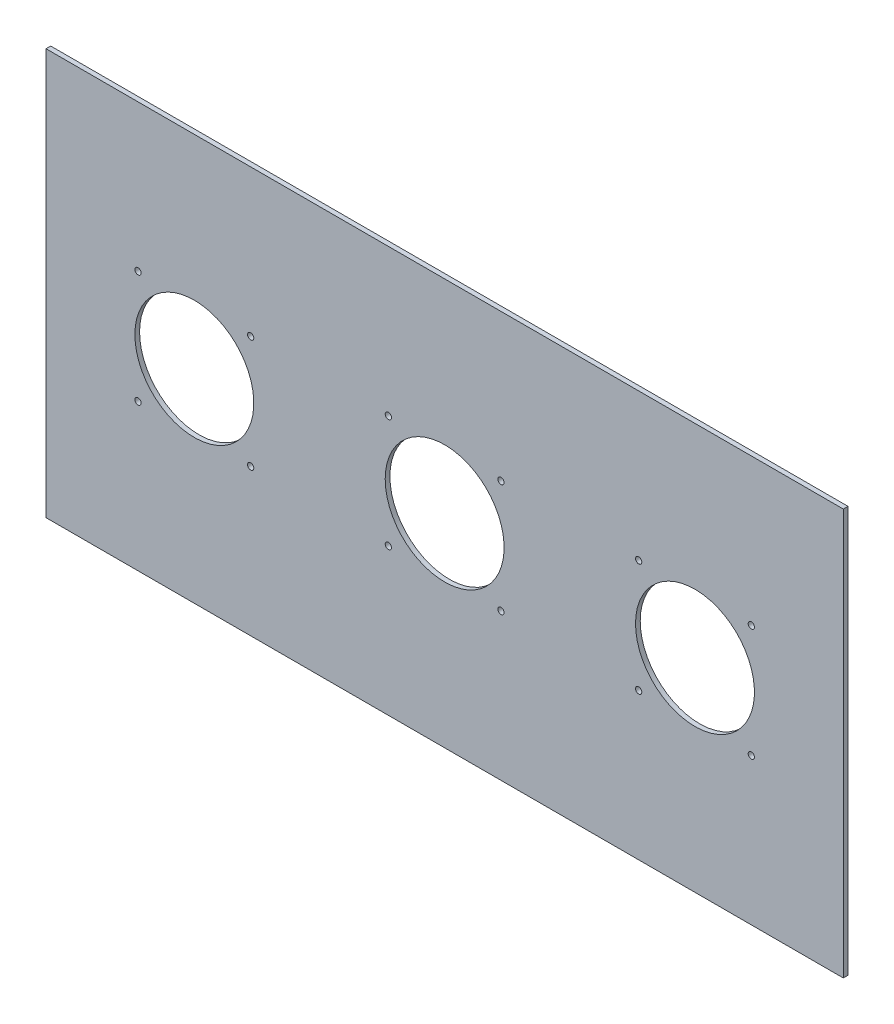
ISO-10303-21;
HEADER;
FILE_DESCRIPTION(('STEP AP214'),'2;1');
FILE_NAME('part.step','',(''),(''),'','','');
FILE_SCHEMA(('AUTOMOTIVE_DESIGN { 1 0 10303 214 1 1 1 1 }'));
ENDSEC;
DATA;
#1=APPLICATION_CONTEXT('core data for automotive mechanical design processes');
#2=APPLICATION_PROTOCOL_DEFINITION('international standard','automotive_design',2000,#1);
#3=PRODUCT_CONTEXT('',#1,'mechanical');
#4=PRODUCT('Part','Part','',(#3));
#5=PRODUCT_RELATED_PRODUCT_CATEGORY('part','',(#4));
#6=PRODUCT_DEFINITION_FORMATION('','',#4);
#7=PRODUCT_DEFINITION_CONTEXT('part definition',#1,'design');
#8=PRODUCT_DEFINITION('design','',#6,#7);
#9=PRODUCT_DEFINITION_SHAPE('','',#8);
#10=(LENGTH_UNIT() NAMED_UNIT(*) SI_UNIT(.MILLI.,.METRE.));
#11=(NAMED_UNIT(*) PLANE_ANGLE_UNIT() SI_UNIT($,.RADIAN.));
#12=(NAMED_UNIT(*) SI_UNIT($,.STERADIAN.) SOLID_ANGLE_UNIT());
#13=UNCERTAINTY_MEASURE_WITH_UNIT(LENGTH_MEASURE(1.E-05),#10,'distance_accuracy_value','');
#14=(GEOMETRIC_REPRESENTATION_CONTEXT(3) GLOBAL_UNCERTAINTY_ASSIGNED_CONTEXT((#13)) GLOBAL_UNIT_ASSIGNED_CONTEXT((#10,
#11,#12)) REPRESENTATION_CONTEXT('',''));
#15=CARTESIAN_POINT('',(0.,0.,0.));
#16=DIRECTION('',(0.,0.,1.));
#17=DIRECTION('',(1.,0.,0.));
#18=AXIS2_PLACEMENT_3D('',#15,#16,#17);
#19=CARTESIAN_POINT('',(-254.8,-129.8,3.));
#20=DIRECTION('',(0.,1.,0.));
#21=DIRECTION('',(0.,0.,1.));
#22=AXIS2_PLACEMENT_3D('',#19,#20,#21);
#23=PLANE('',#22);
#24=DIRECTION('',(1.,0.,0.));
#25=VECTOR('',#24,1.);
#26=CARTESIAN_POINT('',(-254.8,-129.8,0.));
#27=LINE('',#26,#25);
#28=CARTESIAN_POINT('',(-254.8,-129.8,0.));
#29=VERTEX_POINT('',#28);
#30=CARTESIAN_POINT('',(254.8,-129.8,0.));
#31=VERTEX_POINT('',#30);
#32=EDGE_CURVE('E104',#29,#31,#27,.T.);
#33=ORIENTED_EDGE('',*,*,#32,.T.);
#34=DIRECTION('',(0.,0.,-1.));
#35=VECTOR('',#34,1.);
#36=CARTESIAN_POINT('',(254.8,-129.8,3.));
#37=LINE('',#36,#35);
#38=CARTESIAN_POINT('',(254.8,-129.8,3.));
#39=VERTEX_POINT('',#38);
#40=EDGE_CURVE('E12',#39,#31,#37,.T.);
#41=ORIENTED_EDGE('',*,*,#40,.F.);
#42=DIRECTION('',(1.,0.,0.));
#43=VECTOR('',#42,1.);
#44=CARTESIAN_POINT('',(-254.8,-129.8,3.));
#45=LINE('',#44,#43);
#46=CARTESIAN_POINT('',(-254.8,-129.8,3.));
#47=VERTEX_POINT('',#46);
#48=EDGE_CURVE('E90',#47,#39,#45,.T.);
#49=ORIENTED_EDGE('',*,*,#48,.F.);
#50=DIRECTION('',(0.,0.,-1.));
#51=VECTOR('',#50,1.);
#52=CARTESIAN_POINT('',(-254.8,-129.8,3.));
#53=LINE('',#52,#51);
#54=EDGE_CURVE('E57',#47,#29,#53,.T.);
#55=ORIENTED_EDGE('',*,*,#54,.T.);
#56=EDGE_LOOP('',(#33,#41,#49,#55));
#57=FACE_BOUND('',#56,.T.);
#58=ADVANCED_FACE('F41',(#57),#23,.F.);
#59=CARTESIAN_POINT('',(254.8,-129.8,3.));
#60=DIRECTION('',(-1.,0.,0.));
#61=DIRECTION('',(0.,-1.,0.));
#62=AXIS2_PLACEMENT_3D('',#59,#60,#61);
#63=PLANE('',#62);
#64=DIRECTION('',(0.,1.,0.));
#65=VECTOR('',#64,1.);
#66=CARTESIAN_POINT('',(254.8,-129.8,0.));
#67=LINE('',#66,#65);
#68=CARTESIAN_POINT('',(254.8,129.8,0.));
#69=VERTEX_POINT('',#68);
#70=EDGE_CURVE('E95',#31,#69,#67,.T.);
#71=ORIENTED_EDGE('',*,*,#70,.T.);
#72=DIRECTION('',(0.,0.,-1.));
#73=VECTOR('',#72,1.);
#74=CARTESIAN_POINT('',(254.8,129.8,3.));
#75=LINE('',#74,#73);
#76=CARTESIAN_POINT('',(254.8,129.8,3.));
#77=VERTEX_POINT('',#76);
#78=EDGE_CURVE('E49',#77,#69,#75,.T.);
#79=ORIENTED_EDGE('',*,*,#78,.F.);
#80=DIRECTION('',(0.,1.,0.));
#81=VECTOR('',#80,1.);
#82=CARTESIAN_POINT('',(254.8,-129.8,3.));
#83=LINE('',#82,#81);
#84=EDGE_CURVE('E82',#39,#77,#83,.T.);
#85=ORIENTED_EDGE('',*,*,#84,.F.);
#86=ORIENTED_EDGE('',*,*,#40,.T.);
#87=EDGE_LOOP('',(#71,#79,#85,#86));
#88=FACE_BOUND('',#87,.T.);
#89=ADVANCED_FACE('F94',(#88),#63,.F.);
#90=CARTESIAN_POINT('',(-254.8,129.8,3.));
#91=DIRECTION('',(0.,1.,0.));
#92=DIRECTION('',(0.,0.,1.));
#93=AXIS2_PLACEMENT_3D('',#90,#91,#92);
#94=PLANE('',#93);
#95=DIRECTION('',(1.,0.,0.));
#96=VECTOR('',#95,1.);
#97=CARTESIAN_POINT('',(-254.8,129.8,0.));
#98=LINE('',#97,#96);
#99=CARTESIAN_POINT('',(-254.8,129.8,0.));
#100=VERTEX_POINT('',#99);
#101=EDGE_CURVE('E108',#100,#69,#98,.T.);
#102=ORIENTED_EDGE('',*,*,#101,.F.);
#103=DIRECTION('',(0.,0.,-1.));
#104=VECTOR('',#103,1.);
#105=CARTESIAN_POINT('',(-254.8,129.8,3.));
#106=LINE('',#105,#104);
#107=CARTESIAN_POINT('',(-254.8,129.8,3.));
#108=VERTEX_POINT('',#107);
#109=EDGE_CURVE('E71',#108,#100,#106,.T.);
#110=ORIENTED_EDGE('',*,*,#109,.F.);
#111=DIRECTION('',(1.,0.,0.));
#112=VECTOR('',#111,1.);
#113=CARTESIAN_POINT('',(-254.8,129.8,3.));
#114=LINE('',#113,#112);
#115=EDGE_CURVE('E89',#108,#77,#114,.T.);
#116=ORIENTED_EDGE('',*,*,#115,.T.);
#117=ORIENTED_EDGE('',*,*,#78,.T.);
#118=EDGE_LOOP('',(#102,#110,#116,#117));
#119=FACE_BOUND('',#118,.T.);
#120=ADVANCED_FACE('F98',(#119),#94,.T.);
#121=CARTESIAN_POINT('',(-254.8,-129.8,3.));
#122=DIRECTION('',(-1.,0.,0.));
#123=DIRECTION('',(0.,0.,1.));
#124=AXIS2_PLACEMENT_3D('',#121,#122,#123);
#125=PLANE('',#124);
#126=DIRECTION('',(0.,1.,0.));
#127=VECTOR('',#126,1.);
#128=CARTESIAN_POINT('',(-254.8,-129.8,0.));
#129=LINE('',#128,#127);
#130=EDGE_CURVE('E110',#29,#100,#129,.T.);
#131=ORIENTED_EDGE('',*,*,#130,.F.);
#132=ORIENTED_EDGE('',*,*,#54,.F.);
#133=DIRECTION('',(0.,1.,0.));
#134=VECTOR('',#133,1.);
#135=CARTESIAN_POINT('',(-254.8,-129.8,3.));
#136=LINE('',#135,#134);
#137=EDGE_CURVE('E99',#47,#108,#136,.T.);
#138=ORIENTED_EDGE('',*,*,#137,.T.);
#139=ORIENTED_EDGE('',*,*,#109,.T.);
#140=EDGE_LOOP('',(#131,#132,#138,#139));
#141=FACE_BOUND('',#140,.T.);
#142=ADVANCED_FACE('F228',(#141),#125,.T.);
#143=CARTESIAN_POINT('',(0.,0.,3.));
#144=DIRECTION('',(0.,0.,1.));
#145=DIRECTION('',(1.,0.,0.));
#146=AXIS2_PLACEMENT_3D('',#143,#144,#145);
#147=PLANE('',#146);
#148=CARTESIAN_POINT('',(196.,-35.9999999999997,3.));
#149=DIRECTION('',(0.,0.,1.));
#150=DIRECTION('',(1.,0.,0.));
#151=AXIS2_PLACEMENT_3D('',#148,#149,#150);
#152=CIRCLE('',#151,2.);
#153=CARTESIAN_POINT('',(194.,-35.9999999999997,3.));
#154=VERTEX_POINT('',#153);
#155=EDGE_CURVE('E190',#154,#154,#152,.T.);
#156=ORIENTED_EDGE('',*,*,#155,.F.);
#157=EDGE_LOOP('',(#156));
#158=FACE_BOUND('',#157,.T.);
#159=CARTESIAN_POINT('',(160.,2.81025203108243E-13,3.));
#160=DIRECTION('',(0.,0.,1.));
#161=DIRECTION('',(1.,0.,0.));
#162=AXIS2_PLACEMENT_3D('',#159,#160,#161);
#163=CIRCLE('',#162,38.);
#164=CARTESIAN_POINT('',(122.,2.81025203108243E-13,3.));
#165=VERTEX_POINT('',#164);
#166=EDGE_CURVE('E200',#165,#165,#163,.T.);
#167=ORIENTED_EDGE('',*,*,#166,.F.);
#168=EDGE_LOOP('',(#167));
#169=FACE_BOUND('',#168,.T.);
#170=CARTESIAN_POINT('',(124.,-35.9999999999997,3.));
#171=DIRECTION('',(0.,0.,1.));
#172=DIRECTION('',(1.,0.,0.));
#173=AXIS2_PLACEMENT_3D('',#170,#171,#172);
#174=CIRCLE('',#173,2.);
#175=CARTESIAN_POINT('',(122.,-35.9999999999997,3.));
#176=VERTEX_POINT('',#175);
#177=EDGE_CURVE('E183',#176,#176,#174,.T.);
#178=ORIENTED_EDGE('',*,*,#177,.F.);
#179=EDGE_LOOP('',(#178));
#180=FACE_BOUND('',#179,.T.);
#181=CARTESIAN_POINT('',(196.,36.0000000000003,3.));
#182=DIRECTION('',(0.,0.,1.));
#183=DIRECTION('',(1.,0.,0.));
#184=AXIS2_PLACEMENT_3D('',#181,#182,#183);
#185=CIRCLE('',#184,2.);
#186=CARTESIAN_POINT('',(194.,36.0000000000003,3.));
#187=VERTEX_POINT('',#186);
#188=EDGE_CURVE('E151',#187,#187,#185,.T.);
#189=ORIENTED_EDGE('',*,*,#188,.F.);
#190=EDGE_LOOP('',(#189));
#191=FACE_BOUND('',#190,.T.);
#192=CARTESIAN_POINT('',(-196.,-36.0000000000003,3.));
#193=DIRECTION('',(0.,0.,1.));
#194=DIRECTION('',(1.,0.,0.));
#195=AXIS2_PLACEMENT_3D('',#192,#193,#194);
#196=CIRCLE('',#195,2.);
#197=CARTESIAN_POINT('',(-198.,-36.0000000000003,3.));
#198=VERTEX_POINT('',#197);
#199=EDGE_CURVE('E159',#198,#198,#196,.T.);
#200=ORIENTED_EDGE('',*,*,#199,.F.);
#201=EDGE_LOOP('',(#200));
#202=FACE_BOUND('',#201,.T.);
#203=CARTESIAN_POINT('',(-160.,-3.01841884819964E-13,3.));
#204=DIRECTION('',(0.,0.,1.));
#205=DIRECTION('',(1.,0.,0.));
#206=AXIS2_PLACEMENT_3D('',#203,#204,#205);
#207=CIRCLE('',#206,38.);
#208=CARTESIAN_POINT('',(-198.,-3.01841884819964E-13,3.));
#209=VERTEX_POINT('',#208);
#210=EDGE_CURVE('E177',#209,#209,#207,.T.);
#211=ORIENTED_EDGE('',*,*,#210,.F.);
#212=EDGE_LOOP('',(#211));
#213=FACE_BOUND('',#212,.T.);
#214=CARTESIAN_POINT('',(-124.,-36.0000000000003,3.));
#215=DIRECTION('',(0.,0.,1.));
#216=DIRECTION('',(1.,0.,0.));
#217=AXIS2_PLACEMENT_3D('',#214,#215,#216);
#218=CIRCLE('',#217,2.);
#219=CARTESIAN_POINT('',(-126.,-36.0000000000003,3.));
#220=VERTEX_POINT('',#219);
#221=EDGE_CURVE('E171',#220,#220,#218,.T.);
#222=ORIENTED_EDGE('',*,*,#221,.F.);
#223=EDGE_LOOP('',(#222));
#224=FACE_BOUND('',#223,.T.);
#225=CARTESIAN_POINT('',(-124.,35.9999999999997,3.));
#226=DIRECTION('',(0.,0.,1.));
#227=DIRECTION('',(1.,0.,0.));
#228=AXIS2_PLACEMENT_3D('',#225,#226,#227);
#229=CIRCLE('',#228,2.);
#230=CARTESIAN_POINT('',(-126.,35.9999999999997,3.));
#231=VERTEX_POINT('',#230);
#232=EDGE_CURVE('E152',#231,#231,#229,.T.);
#233=ORIENTED_EDGE('',*,*,#232,.F.);
#234=EDGE_LOOP('',(#233));
#235=FACE_BOUND('',#234,.T.);
#236=CARTESIAN_POINT('',(-196.,35.9999999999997,3.));
#237=DIRECTION('',(0.,0.,1.));
#238=DIRECTION('',(1.,0.,0.));
#239=AXIS2_PLACEMENT_3D('',#236,#237,#238);
#240=CIRCLE('',#239,2.);
#241=CARTESIAN_POINT('',(-198.,35.9999999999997,3.));
#242=VERTEX_POINT('',#241);
#243=EDGE_CURVE('E160',#242,#242,#240,.T.);
#244=ORIENTED_EDGE('',*,*,#243,.F.);
#245=EDGE_LOOP('',(#244));
#246=FACE_BOUND('',#245,.T.);
#247=CARTESIAN_POINT('',(124.,36.0000000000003,3.));
#248=DIRECTION('',(0.,0.,1.));
#249=DIRECTION('',(1.,0.,0.));
#250=AXIS2_PLACEMENT_3D('',#247,#248,#249);
#251=CIRCLE('',#250,2.);
#252=CARTESIAN_POINT('',(122.,36.0000000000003,3.));
#253=VERTEX_POINT('',#252);
#254=EDGE_CURVE('E145',#253,#253,#251,.T.);
#255=ORIENTED_EDGE('',*,*,#254,.F.);
#256=EDGE_LOOP('',(#255));
#257=FACE_BOUND('',#256,.T.);
#258=CARTESIAN_POINT('',(36.,-36.,3.));
#259=DIRECTION('',(0.,0.,1.));
#260=DIRECTION('',(1.,0.,0.));
#261=AXIS2_PLACEMENT_3D('',#258,#259,#260);
#262=CIRCLE('',#261,2.);
#263=CARTESIAN_POINT('',(34.,-36.,3.));
#264=VERTEX_POINT('',#263);
#265=EDGE_CURVE('E129',#264,#264,#262,.T.);
#266=ORIENTED_EDGE('',*,*,#265,.F.);
#267=EDGE_LOOP('',(#266));
#268=FACE_BOUND('',#267,.T.);
#269=CARTESIAN_POINT('',(0.,0.,3.));
#270=DIRECTION('',(0.,0.,1.));
#271=DIRECTION('',(1.,0.,0.));
#272=AXIS2_PLACEMENT_3D('',#269,#270,#271);
#273=CIRCLE('',#272,38.);
#274=CARTESIAN_POINT('',(-38.,0.,3.));
#275=VERTEX_POINT('',#274);
#276=EDGE_CURVE('E139',#275,#275,#273,.T.);
#277=ORIENTED_EDGE('',*,*,#276,.F.);
#278=EDGE_LOOP('',(#277));
#279=FACE_BOUND('',#278,.T.);
#280=CARTESIAN_POINT('',(-36.,-36.,3.));
#281=DIRECTION('',(0.,0.,1.));
#282=DIRECTION('',(1.,0.,0.));
#283=AXIS2_PLACEMENT_3D('',#280,#281,#282);
#284=CIRCLE('',#283,2.);
#285=CARTESIAN_POINT('',(-38.,-36.,3.));
#286=VERTEX_POINT('',#285);
#287=EDGE_CURVE('E122',#286,#286,#284,.T.);
#288=ORIENTED_EDGE('',*,*,#287,.F.);
#289=EDGE_LOOP('',(#288));
#290=FACE_BOUND('',#289,.T.);
#291=CARTESIAN_POINT('',(36.,36.,3.));
#292=DIRECTION('',(0.,0.,1.));
#293=DIRECTION('',(1.,0.,0.));
#294=AXIS2_PLACEMENT_3D('',#291,#292,#293);
#295=CIRCLE('',#294,2.);
#296=CARTESIAN_POINT('',(34.,36.,3.));
#297=VERTEX_POINT('',#296);
#298=EDGE_CURVE('E121',#297,#297,#295,.T.);
#299=ORIENTED_EDGE('',*,*,#298,.F.);
#300=EDGE_LOOP('',(#299));
#301=FACE_BOUND('',#300,.T.);
#302=CARTESIAN_POINT('',(-36.,36.,3.));
#303=DIRECTION('',(0.,0.,1.));
#304=DIRECTION('',(1.,0.,0.));
#305=AXIS2_PLACEMENT_3D('',#302,#303,#304);
#306=CIRCLE('',#305,2.);
#307=CARTESIAN_POINT('',(-38.,36.,3.));
#308=VERTEX_POINT('',#307);
#309=EDGE_CURVE('E106',#308,#308,#306,.T.);
#310=ORIENTED_EDGE('',*,*,#309,.F.);
#311=EDGE_LOOP('',(#310));
#312=FACE_BOUND('',#311,.T.);
#313=ORIENTED_EDGE('',*,*,#48,.T.);
#314=ORIENTED_EDGE('',*,*,#84,.T.);
#315=ORIENTED_EDGE('',*,*,#115,.F.);
#316=ORIENTED_EDGE('',*,*,#137,.F.);
#317=EDGE_LOOP('',(#313,#314,#315,#316));
#318=FACE_BOUND('',#317,.T.);
#319=ADVANCED_FACE('F86',(#158,#169,#180,#191,#202,#213,#224,#235,#246,#257,#268,#279,#290,#301,
#312,#318),#147,.T.);
#320=CARTESIAN_POINT('',(0.,0.,0.));
#321=DIRECTION('',(0.,0.,1.));
#322=DIRECTION('',(1.,0.,0.));
#323=AXIS2_PLACEMENT_3D('',#320,#321,#322);
#324=PLANE('',#323);
#325=CARTESIAN_POINT('',(196.,-35.9999999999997,0.));
#326=DIRECTION('',(0.,0.,1.));
#327=DIRECTION('',(1.,0.,0.));
#328=AXIS2_PLACEMENT_3D('',#325,#326,#327);
#329=CIRCLE('',#328,2.);
#330=CARTESIAN_POINT('',(194.,-35.9999999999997,0.));
#331=VERTEX_POINT('',#330);
#332=EDGE_CURVE('E197',#331,#331,#329,.T.);
#333=ORIENTED_EDGE('',*,*,#332,.T.);
#334=EDGE_LOOP('',(#333));
#335=FACE_BOUND('',#334,.T.);
#336=CARTESIAN_POINT('',(160.,2.81025203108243E-13,0.));
#337=DIRECTION('',(0.,0.,1.));
#338=DIRECTION('',(1.,0.,0.));
#339=AXIS2_PLACEMENT_3D('',#336,#337,#338);
#340=CIRCLE('',#339,38.);
#341=CARTESIAN_POINT('',(122.,2.81025203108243E-13,0.));
#342=VERTEX_POINT('',#341);
#343=EDGE_CURVE('E163',#342,#342,#340,.T.);
#344=ORIENTED_EDGE('',*,*,#343,.T.);
#345=EDGE_LOOP('',(#344));
#346=FACE_BOUND('',#345,.T.);
#347=CARTESIAN_POINT('',(124.,-35.9999999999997,0.));
#348=DIRECTION('',(0.,0.,1.));
#349=DIRECTION('',(1.,0.,0.));
#350=AXIS2_PLACEMENT_3D('',#347,#348,#349);
#351=CIRCLE('',#350,2.);
#352=CARTESIAN_POINT('',(122.,-35.9999999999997,0.));
#353=VERTEX_POINT('',#352);
#354=EDGE_CURVE('E187',#353,#353,#351,.T.);
#355=ORIENTED_EDGE('',*,*,#354,.T.);
#356=EDGE_LOOP('',(#355));
#357=FACE_BOUND('',#356,.T.);
#358=CARTESIAN_POINT('',(196.,36.0000000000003,0.));
#359=DIRECTION('',(0.,0.,1.));
#360=DIRECTION('',(1.,0.,0.));
#361=AXIS2_PLACEMENT_3D('',#358,#359,#360);
#362=CIRCLE('',#361,2.);
#363=CARTESIAN_POINT('',(194.,36.0000000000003,0.));
#364=VERTEX_POINT('',#363);
#365=EDGE_CURVE('E186',#364,#364,#362,.T.);
#366=ORIENTED_EDGE('',*,*,#365,.T.);
#367=EDGE_LOOP('',(#366));
#368=FACE_BOUND('',#367,.T.);
#369=CARTESIAN_POINT('',(-196.,-36.0000000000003,0.));
#370=DIRECTION('',(0.,0.,1.));
#371=DIRECTION('',(1.,0.,0.));
#372=AXIS2_PLACEMENT_3D('',#369,#370,#371);
#373=CIRCLE('',#372,2.);
#374=CARTESIAN_POINT('',(-198.,-36.0000000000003,0.));
#375=VERTEX_POINT('',#374);
#376=EDGE_CURVE('E168',#375,#375,#373,.T.);
#377=ORIENTED_EDGE('',*,*,#376,.T.);
#378=EDGE_LOOP('',(#377));
#379=FACE_BOUND('',#378,.T.);
#380=CARTESIAN_POINT('',(-160.,-3.01841884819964E-13,0.));
#381=DIRECTION('',(0.,0.,1.));
#382=DIRECTION('',(1.,0.,0.));
#383=AXIS2_PLACEMENT_3D('',#380,#381,#382);
#384=CIRCLE('',#383,38.);
#385=CARTESIAN_POINT('',(-198.,-3.01841884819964E-13,0.));
#386=VERTEX_POINT('',#385);
#387=EDGE_CURVE('E180',#386,#386,#384,.T.);
#388=ORIENTED_EDGE('',*,*,#387,.T.);
#389=EDGE_LOOP('',(#388));
#390=FACE_BOUND('',#389,.T.);
#391=CARTESIAN_POINT('',(-124.,-36.0000000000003,0.));
#392=DIRECTION('',(0.,0.,1.));
#393=DIRECTION('',(1.,0.,0.));
#394=AXIS2_PLACEMENT_3D('',#391,#392,#393);
#395=CIRCLE('',#394,2.);
#396=CARTESIAN_POINT('',(-126.,-36.0000000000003,0.));
#397=VERTEX_POINT('',#396);
#398=EDGE_CURVE('E174',#397,#397,#395,.T.);
#399=ORIENTED_EDGE('',*,*,#398,.T.);
#400=EDGE_LOOP('',(#399));
#401=FACE_BOUND('',#400,.T.);
#402=CARTESIAN_POINT('',(-124.,35.9999999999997,0.));
#403=DIRECTION('',(0.,0.,1.));
#404=DIRECTION('',(1.,0.,0.));
#405=AXIS2_PLACEMENT_3D('',#402,#403,#404);
#406=CIRCLE('',#405,2.);
#407=CARTESIAN_POINT('',(-126.,35.9999999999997,0.));
#408=VERTEX_POINT('',#407);
#409=EDGE_CURVE('E156',#408,#408,#406,.T.);
#410=ORIENTED_EDGE('',*,*,#409,.T.);
#411=EDGE_LOOP('',(#410));
#412=FACE_BOUND('',#411,.T.);
#413=CARTESIAN_POINT('',(-196.,35.9999999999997,0.));
#414=DIRECTION('',(0.,0.,1.));
#415=DIRECTION('',(1.,0.,0.));
#416=AXIS2_PLACEMENT_3D('',#413,#414,#415);
#417=CIRCLE('',#416,2.);
#418=CARTESIAN_POINT('',(-198.,35.9999999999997,0.));
#419=VERTEX_POINT('',#418);
#420=EDGE_CURVE('E155',#419,#419,#417,.T.);
#421=ORIENTED_EDGE('',*,*,#420,.T.);
#422=EDGE_LOOP('',(#421));
#423=FACE_BOUND('',#422,.T.);
#424=CARTESIAN_POINT('',(124.,36.0000000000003,0.));
#425=DIRECTION('',(0.,0.,1.));
#426=DIRECTION('',(1.,0.,0.));
#427=AXIS2_PLACEMENT_3D('',#424,#425,#426);
#428=CIRCLE('',#427,2.);
#429=CARTESIAN_POINT('',(122.,36.0000000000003,0.));
#430=VERTEX_POINT('',#429);
#431=EDGE_CURVE('E148',#430,#430,#428,.T.);
#432=ORIENTED_EDGE('',*,*,#431,.T.);
#433=EDGE_LOOP('',(#432));
#434=FACE_BOUND('',#433,.T.);
#435=CARTESIAN_POINT('',(36.,-36.,0.));
#436=DIRECTION('',(0.,0.,1.));
#437=DIRECTION('',(1.,0.,0.));
#438=AXIS2_PLACEMENT_3D('',#435,#436,#437);
#439=CIRCLE('',#438,2.);
#440=CARTESIAN_POINT('',(34.,-36.,0.));
#441=VERTEX_POINT('',#440);
#442=EDGE_CURVE('E136',#441,#441,#439,.T.);
#443=ORIENTED_EDGE('',*,*,#442,.T.);
#444=EDGE_LOOP('',(#443));
#445=FACE_BOUND('',#444,.T.);
#446=CARTESIAN_POINT('',(0.,0.,0.));
#447=DIRECTION('',(0.,0.,1.));
#448=DIRECTION('',(1.,0.,0.));
#449=AXIS2_PLACEMENT_3D('',#446,#447,#448);
#450=CIRCLE('',#449,38.);
#451=CARTESIAN_POINT('',(-38.,0.,0.));
#452=VERTEX_POINT('',#451);
#453=EDGE_CURVE('E142',#452,#452,#450,.T.);
#454=ORIENTED_EDGE('',*,*,#453,.T.);
#455=EDGE_LOOP('',(#454));
#456=FACE_BOUND('',#455,.T.);
#457=CARTESIAN_POINT('',(-36.,-36.,0.));
#458=DIRECTION('',(0.,0.,1.));
#459=DIRECTION('',(1.,0.,0.));
#460=AXIS2_PLACEMENT_3D('',#457,#458,#459);
#461=CIRCLE('',#460,2.);
#462=CARTESIAN_POINT('',(-38.,-36.,0.));
#463=VERTEX_POINT('',#462);
#464=EDGE_CURVE('E126',#463,#463,#461,.T.);
#465=ORIENTED_EDGE('',*,*,#464,.T.);
#466=EDGE_LOOP('',(#465));
#467=FACE_BOUND('',#466,.T.);
#468=CARTESIAN_POINT('',(36.,36.,0.));
#469=DIRECTION('',(0.,0.,1.));
#470=DIRECTION('',(1.,0.,0.));
#471=AXIS2_PLACEMENT_3D('',#468,#469,#470);
#472=CIRCLE('',#471,2.);
#473=CARTESIAN_POINT('',(34.,36.,0.));
#474=VERTEX_POINT('',#473);
#475=EDGE_CURVE('E125',#474,#474,#472,.T.);
#476=ORIENTED_EDGE('',*,*,#475,.T.);
#477=EDGE_LOOP('',(#476));
#478=FACE_BOUND('',#477,.T.);
#479=CARTESIAN_POINT('',(-36.,36.,0.));
#480=DIRECTION('',(0.,0.,1.));
#481=DIRECTION('',(1.,0.,0.));
#482=AXIS2_PLACEMENT_3D('',#479,#480,#481);
#483=CIRCLE('',#482,2.);
#484=CARTESIAN_POINT('',(-38.,36.,0.));
#485=VERTEX_POINT('',#484);
#486=EDGE_CURVE('E118',#485,#485,#483,.T.);
#487=ORIENTED_EDGE('',*,*,#486,.T.);
#488=EDGE_LOOP('',(#487));
#489=FACE_BOUND('',#488,.T.);
#490=ORIENTED_EDGE('',*,*,#32,.F.);
#491=ORIENTED_EDGE('',*,*,#130,.T.);
#492=ORIENTED_EDGE('',*,*,#101,.T.);
#493=ORIENTED_EDGE('',*,*,#70,.F.);
#494=EDGE_LOOP('',(#490,#491,#492,#493));
#495=FACE_BOUND('',#494,.T.);
#496=ADVANCED_FACE('F206',(#335,#346,#357,#368,#379,#390,#401,#412,#423,#434,#445,#456,#467,
#478,#489,#495),#324,.F.);
#497=CARTESIAN_POINT('',(-36.,36.,3.001));
#498=DIRECTION('',(0.,0.,-1.));
#499=DIRECTION('',(-1.,0.,0.));
#500=AXIS2_PLACEMENT_3D('',#497,#498,#499);
#501=CYLINDRICAL_SURFACE('',#500,2.);
#502=CARTESIAN_POINT('',(-38.,36.,3.));
#503=CARTESIAN_POINT('',(-38.,36.,2.96875));
#504=CARTESIAN_POINT('',(-38.,36.,2.9375));
#505=CARTESIAN_POINT('',(-38.,36.,2.875));
#506=CARTESIAN_POINT('',(-38.,36.,2.84375));
#507=CARTESIAN_POINT('',(-38.,36.,2.78125));
#508=CARTESIAN_POINT('',(-38.,36.,2.75));
#509=CARTESIAN_POINT('',(-38.,36.,2.6875));
#510=CARTESIAN_POINT('',(-38.,36.,2.65625));
#511=CARTESIAN_POINT('',(-38.,36.,2.59375));
#512=CARTESIAN_POINT('',(-38.,36.,2.5625));
#513=CARTESIAN_POINT('',(-38.,36.,2.5));
#514=CARTESIAN_POINT('',(-38.,36.,2.46875));
#515=CARTESIAN_POINT('',(-38.,36.,2.40625));
#516=CARTESIAN_POINT('',(-38.,36.,2.375));
#517=CARTESIAN_POINT('',(-38.,36.,2.3125));
#518=CARTESIAN_POINT('',(-38.,36.,2.28125));
#519=CARTESIAN_POINT('',(-38.,36.,2.21875));
#520=CARTESIAN_POINT('',(-38.,36.,2.1875));
#521=CARTESIAN_POINT('',(-38.,36.,2.125));
#522=CARTESIAN_POINT('',(-38.,36.,2.09375));
#523=CARTESIAN_POINT('',(-38.,36.,2.03125));
#524=CARTESIAN_POINT('',(-38.,36.,2.));
#525=CARTESIAN_POINT('',(-38.,36.,1.9375));
#526=CARTESIAN_POINT('',(-38.,36.,1.90625));
#527=CARTESIAN_POINT('',(-38.,36.,1.84375));
#528=CARTESIAN_POINT('',(-38.,36.,1.8125));
#529=CARTESIAN_POINT('',(-38.,36.,1.75));
#530=CARTESIAN_POINT('',(-38.,36.,1.71875));
#531=CARTESIAN_POINT('',(-38.,36.,1.65625));
#532=CARTESIAN_POINT('',(-38.,36.,1.625));
#533=CARTESIAN_POINT('',(-38.,36.,1.5625));
#534=CARTESIAN_POINT('',(-38.,36.,1.53125));
#535=CARTESIAN_POINT('',(-38.,36.,1.46875));
#536=CARTESIAN_POINT('',(-38.,36.,1.4375));
#537=CARTESIAN_POINT('',(-38.,36.,1.375));
#538=CARTESIAN_POINT('',(-38.,36.,1.34375));
#539=CARTESIAN_POINT('',(-38.,36.,1.28125));
#540=CARTESIAN_POINT('',(-38.,36.,1.25));
#541=CARTESIAN_POINT('',(-38.,36.,1.1875));
#542=CARTESIAN_POINT('',(-38.,36.,1.15625));
#543=CARTESIAN_POINT('',(-38.,36.,1.09375));
#544=CARTESIAN_POINT('',(-38.,36.,1.0625));
#545=CARTESIAN_POINT('',(-38.,36.,1.));
#546=CARTESIAN_POINT('',(-38.,36.,0.96875));
#547=CARTESIAN_POINT('',(-38.,36.,0.90625));
#548=CARTESIAN_POINT('',(-38.,36.,0.875));
#549=CARTESIAN_POINT('',(-38.,36.,0.8125));
#550=CARTESIAN_POINT('',(-38.,36.,0.78125));
#551=CARTESIAN_POINT('',(-38.,36.,0.71875));
#552=CARTESIAN_POINT('',(-38.,36.,0.6875));
#553=CARTESIAN_POINT('',(-38.,36.,0.625));
#554=CARTESIAN_POINT('',(-38.,36.,0.59375));
#555=CARTESIAN_POINT('',(-38.,36.,0.53125));
#556=CARTESIAN_POINT('',(-38.,36.,0.5));
#557=CARTESIAN_POINT('',(-38.,36.,0.4375));
#558=CARTESIAN_POINT('',(-38.,36.,0.40625));
#559=CARTESIAN_POINT('',(-38.,36.,0.34375));
#560=CARTESIAN_POINT('',(-38.,36.,0.3125));
#561=CARTESIAN_POINT('',(-38.,36.,0.25));
#562=CARTESIAN_POINT('',(-38.,36.,0.21875));
#563=CARTESIAN_POINT('',(-38.,36.,0.15625));
#564=CARTESIAN_POINT('',(-38.,36.,0.125));
#565=CARTESIAN_POINT('',(-38.,36.,0.0624999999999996));
#566=CARTESIAN_POINT('',(-38.,36.,0.0312499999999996));
#567=CARTESIAN_POINT('',(-38.,36.,0.));
#568=B_SPLINE_CURVE_WITH_KNOTS('',3,(#502,#503,#504,#505,#506,#507,#508,#509,#510,#511,#512,
#513,#514,#515,#516,#517,#518,#519,#520,#521,#522,#523,#524,#525,#526,#527,#528,#529,#530,#531,
#532,#533,#534,#535,#536,#537,#538,#539,#540,#541,#542,#543,#544,#545,#546,#547,#548,#549,#550,
#551,#552,#553,#554,#555,#556,#557,#558,#559,#560,#561,#562,#563,#564,#565,#566,#567),
.UNSPECIFIED.,.F.,.F.,(4,2,2,2,2,2,2,2,2,2,2,2,2,2,2,2,2,2,2,2,2,2,2,2,2,2,2,2,2,2,2,2,4),(0.,
0.0937499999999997,0.1875,0.28125,0.375,0.46875,0.5625,0.65625,0.75,0.84375,0.9375,1.03125,
1.125,1.21875,1.3125,1.40625,1.5,1.59375,1.6875,1.78125,1.875,1.96875,2.0625,2.15625,2.25,
2.34375,2.4375,2.53125,2.625,2.71875,2.8125,2.90625,3.),.UNSPECIFIED.);
#569=EDGE_CURVE('BSEAM241',#308,#485,#568,.T.);
#570=ORIENTED_EDGE('',*,*,#309,.T.);
#571=ORIENTED_EDGE('',*,*,#486,.F.);
#572=ORIENTED_EDGE('',*,*,#569,.T.);
#573=ORIENTED_EDGE('',*,*,#569,.F.);
#574=EDGE_LOOP('',(#570,#572,#571,#573));
#575=FACE_BOUND('',#574,.T.);
#576=ADVANCED_FACE('F241',(#575),#501,.F.);
#577=CARTESIAN_POINT('',(36.,36.,3.001));
#578=DIRECTION('',(0.,0.,-1.));
#579=DIRECTION('',(-1.,0.,0.));
#580=AXIS2_PLACEMENT_3D('',#577,#578,#579);
#581=CYLINDRICAL_SURFACE('',#580,2.);
#582=CARTESIAN_POINT('',(34.,36.,3.));
#583=CARTESIAN_POINT('',(34.,36.,2.96875));
#584=CARTESIAN_POINT('',(34.,36.,2.9375));
#585=CARTESIAN_POINT('',(34.,36.,2.875));
#586=CARTESIAN_POINT('',(34.,36.,2.84375));
#587=CARTESIAN_POINT('',(34.,36.,2.78125));
#588=CARTESIAN_POINT('',(34.,36.,2.75));
#589=CARTESIAN_POINT('',(34.,36.,2.6875));
#590=CARTESIAN_POINT('',(34.,36.,2.65625));
#591=CARTESIAN_POINT('',(34.,36.,2.59375));
#592=CARTESIAN_POINT('',(34.,36.,2.5625));
#593=CARTESIAN_POINT('',(34.,36.,2.5));
#594=CARTESIAN_POINT('',(34.,36.,2.46875));
#595=CARTESIAN_POINT('',(34.,36.,2.40625));
#596=CARTESIAN_POINT('',(34.,36.,2.375));
#597=CARTESIAN_POINT('',(34.,36.,2.3125));
#598=CARTESIAN_POINT('',(34.,36.,2.28125));
#599=CARTESIAN_POINT('',(34.,36.,2.21875));
#600=CARTESIAN_POINT('',(34.,36.,2.1875));
#601=CARTESIAN_POINT('',(34.,36.,2.125));
#602=CARTESIAN_POINT('',(34.,36.,2.09375));
#603=CARTESIAN_POINT('',(34.,36.,2.03125));
#604=CARTESIAN_POINT('',(34.,36.,2.));
#605=CARTESIAN_POINT('',(34.,36.,1.9375));
#606=CARTESIAN_POINT('',(34.,36.,1.90625));
#607=CARTESIAN_POINT('',(34.,36.,1.84375));
#608=CARTESIAN_POINT('',(34.,36.,1.8125));
#609=CARTESIAN_POINT('',(34.,36.,1.75));
#610=CARTESIAN_POINT('',(34.,36.,1.71875));
#611=CARTESIAN_POINT('',(34.,36.,1.65625));
#612=CARTESIAN_POINT('',(34.,36.,1.625));
#613=CARTESIAN_POINT('',(34.,36.,1.5625));
#614=CARTESIAN_POINT('',(34.,36.,1.53125));
#615=CARTESIAN_POINT('',(34.,36.,1.46875));
#616=CARTESIAN_POINT('',(34.,36.,1.4375));
#617=CARTESIAN_POINT('',(34.,36.,1.375));
#618=CARTESIAN_POINT('',(34.,36.,1.34375));
#619=CARTESIAN_POINT('',(34.,36.,1.28125));
#620=CARTESIAN_POINT('',(34.,36.,1.25));
#621=CARTESIAN_POINT('',(34.,36.,1.1875));
#622=CARTESIAN_POINT('',(34.,36.,1.15625));
#623=CARTESIAN_POINT('',(34.,36.,1.09375));
#624=CARTESIAN_POINT('',(34.,36.,1.0625));
#625=CARTESIAN_POINT('',(34.,36.,1.));
#626=CARTESIAN_POINT('',(34.,36.,0.96875));
#627=CARTESIAN_POINT('',(34.,36.,0.90625));
#628=CARTESIAN_POINT('',(34.,36.,0.875));
#629=CARTESIAN_POINT('',(34.,36.,0.8125));
#630=CARTESIAN_POINT('',(34.,36.,0.78125));
#631=CARTESIAN_POINT('',(34.,36.,0.71875));
#632=CARTESIAN_POINT('',(34.,36.,0.6875));
#633=CARTESIAN_POINT('',(34.,36.,0.625));
#634=CARTESIAN_POINT('',(34.,36.,0.59375));
#635=CARTESIAN_POINT('',(34.,36.,0.53125));
#636=CARTESIAN_POINT('',(34.,36.,0.5));
#637=CARTESIAN_POINT('',(34.,36.,0.4375));
#638=CARTESIAN_POINT('',(34.,36.,0.40625));
#639=CARTESIAN_POINT('',(34.,36.,0.34375));
#640=CARTESIAN_POINT('',(34.,36.,0.3125));
#641=CARTESIAN_POINT('',(34.,36.,0.25));
#642=CARTESIAN_POINT('',(34.,36.,0.21875));
#643=CARTESIAN_POINT('',(34.,36.,0.15625));
#644=CARTESIAN_POINT('',(34.,36.,0.125));
#645=CARTESIAN_POINT('',(34.,36.,0.0624999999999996));
#646=CARTESIAN_POINT('',(34.,36.,0.0312499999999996));
#647=CARTESIAN_POINT('',(34.,36.,0.));
#648=B_SPLINE_CURVE_WITH_KNOTS('',3,(#582,#583,#584,#585,#586,#587,#588,#589,#590,#591,#592,
#593,#594,#595,#596,#597,#598,#599,#600,#601,#602,#603,#604,#605,#606,#607,#608,#609,#610,#611,
#612,#613,#614,#615,#616,#617,#618,#619,#620,#621,#622,#623,#624,#625,#626,#627,#628,#629,#630,
#631,#632,#633,#634,#635,#636,#637,#638,#639,#640,#641,#642,#643,#644,#645,#646,#647),
.UNSPECIFIED.,.F.,.F.,(4,2,2,2,2,2,2,2,2,2,2,2,2,2,2,2,2,2,2,2,2,2,2,2,2,2,2,2,2,2,2,2,4),(0.,
0.0937499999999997,0.1875,0.28125,0.375,0.46875,0.5625,0.65625,0.75,0.84375,0.9375,1.03125,
1.125,1.21875,1.3125,1.40625,1.5,1.59375,1.6875,1.78125,1.875,1.96875,2.0625,2.15625,2.25,
2.34375,2.4375,2.53125,2.625,2.71875,2.8125,2.90625,3.),.UNSPECIFIED.);
#649=EDGE_CURVE('BSEAM246',#297,#474,#648,.T.);
#650=ORIENTED_EDGE('',*,*,#298,.T.);
#651=ORIENTED_EDGE('',*,*,#475,.F.);
#652=ORIENTED_EDGE('',*,*,#649,.T.);
#653=ORIENTED_EDGE('',*,*,#649,.F.);
#654=EDGE_LOOP('',(#650,#652,#651,#653));
#655=FACE_BOUND('',#654,.T.);
#656=ADVANCED_FACE('F246',(#655),#581,.F.);
#657=CARTESIAN_POINT('',(-36.,-36.,3.001));
#658=DIRECTION('',(0.,0.,-1.));
#659=DIRECTION('',(-1.,0.,0.));
#660=AXIS2_PLACEMENT_3D('',#657,#658,#659);
#661=CYLINDRICAL_SURFACE('',#660,2.);
#662=CARTESIAN_POINT('',(-38.,-36.,3.));
#663=CARTESIAN_POINT('',(-38.,-36.,2.96875));
#664=CARTESIAN_POINT('',(-38.,-36.,2.9375));
#665=CARTESIAN_POINT('',(-38.,-36.,2.875));
#666=CARTESIAN_POINT('',(-38.,-36.,2.84375));
#667=CARTESIAN_POINT('',(-38.,-36.,2.78125));
#668=CARTESIAN_POINT('',(-38.,-36.,2.75));
#669=CARTESIAN_POINT('',(-38.,-36.,2.6875));
#670=CARTESIAN_POINT('',(-38.,-36.,2.65625));
#671=CARTESIAN_POINT('',(-38.,-36.,2.59375));
#672=CARTESIAN_POINT('',(-38.,-36.,2.5625));
#673=CARTESIAN_POINT('',(-38.,-36.,2.5));
#674=CARTESIAN_POINT('',(-38.,-36.,2.46875));
#675=CARTESIAN_POINT('',(-38.,-36.,2.40625));
#676=CARTESIAN_POINT('',(-38.,-36.,2.375));
#677=CARTESIAN_POINT('',(-38.,-36.,2.3125));
#678=CARTESIAN_POINT('',(-38.,-36.,2.28125));
#679=CARTESIAN_POINT('',(-38.,-36.,2.21875));
#680=CARTESIAN_POINT('',(-38.,-36.,2.1875));
#681=CARTESIAN_POINT('',(-38.,-36.,2.125));
#682=CARTESIAN_POINT('',(-38.,-36.,2.09375));
#683=CARTESIAN_POINT('',(-38.,-36.,2.03125));
#684=CARTESIAN_POINT('',(-38.,-36.,2.));
#685=CARTESIAN_POINT('',(-38.,-36.,1.9375));
#686=CARTESIAN_POINT('',(-38.,-36.,1.90625));
#687=CARTESIAN_POINT('',(-38.,-36.,1.84375));
#688=CARTESIAN_POINT('',(-38.,-36.,1.8125));
#689=CARTESIAN_POINT('',(-38.,-36.,1.75));
#690=CARTESIAN_POINT('',(-38.,-36.,1.71875));
#691=CARTESIAN_POINT('',(-38.,-36.,1.65625));
#692=CARTESIAN_POINT('',(-38.,-36.,1.625));
#693=CARTESIAN_POINT('',(-38.,-36.,1.5625));
#694=CARTESIAN_POINT('',(-38.,-36.,1.53125));
#695=CARTESIAN_POINT('',(-38.,-36.,1.46875));
#696=CARTESIAN_POINT('',(-38.,-36.,1.4375));
#697=CARTESIAN_POINT('',(-38.,-36.,1.375));
#698=CARTESIAN_POINT('',(-38.,-36.,1.34375));
#699=CARTESIAN_POINT('',(-38.,-36.,1.28125));
#700=CARTESIAN_POINT('',(-38.,-36.,1.25));
#701=CARTESIAN_POINT('',(-38.,-36.,1.1875));
#702=CARTESIAN_POINT('',(-38.,-36.,1.15625));
#703=CARTESIAN_POINT('',(-38.,-36.,1.09375));
#704=CARTESIAN_POINT('',(-38.,-36.,1.0625));
#705=CARTESIAN_POINT('',(-38.,-36.,1.));
#706=CARTESIAN_POINT('',(-38.,-36.,0.96875));
#707=CARTESIAN_POINT('',(-38.,-36.,0.90625));
#708=CARTESIAN_POINT('',(-38.,-36.,0.875));
#709=CARTESIAN_POINT('',(-38.,-36.,0.8125));
#710=CARTESIAN_POINT('',(-38.,-36.,0.78125));
#711=CARTESIAN_POINT('',(-38.,-36.,0.71875));
#712=CARTESIAN_POINT('',(-38.,-36.,0.6875));
#713=CARTESIAN_POINT('',(-38.,-36.,0.625));
#714=CARTESIAN_POINT('',(-38.,-36.,0.59375));
#715=CARTESIAN_POINT('',(-38.,-36.,0.53125));
#716=CARTESIAN_POINT('',(-38.,-36.,0.5));
#717=CARTESIAN_POINT('',(-38.,-36.,0.4375));
#718=CARTESIAN_POINT('',(-38.,-36.,0.40625));
#719=CARTESIAN_POINT('',(-38.,-36.,0.34375));
#720=CARTESIAN_POINT('',(-38.,-36.,0.3125));
#721=CARTESIAN_POINT('',(-38.,-36.,0.25));
#722=CARTESIAN_POINT('',(-38.,-36.,0.21875));
#723=CARTESIAN_POINT('',(-38.,-36.,0.15625));
#724=CARTESIAN_POINT('',(-38.,-36.,0.125));
#725=CARTESIAN_POINT('',(-38.,-36.,0.0624999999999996));
#726=CARTESIAN_POINT('',(-38.,-36.,0.0312499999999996));
#727=CARTESIAN_POINT('',(-38.,-36.,0.));
#728=B_SPLINE_CURVE_WITH_KNOTS('',3,(#662,#663,#664,#665,#666,#667,#668,#669,#670,#671,#672,
#673,#674,#675,#676,#677,#678,#679,#680,#681,#682,#683,#684,#685,#686,#687,#688,#689,#690,#691,
#692,#693,#694,#695,#696,#697,#698,#699,#700,#701,#702,#703,#704,#705,#706,#707,#708,#709,#710,
#711,#712,#713,#714,#715,#716,#717,#718,#719,#720,#721,#722,#723,#724,#725,#726,#727),
.UNSPECIFIED.,.F.,.F.,(4,2,2,2,2,2,2,2,2,2,2,2,2,2,2,2,2,2,2,2,2,2,2,2,2,2,2,2,2,2,2,2,4),(0.,
0.0937499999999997,0.1875,0.28125,0.375,0.46875,0.5625,0.65625,0.75,0.84375,0.9375,1.03125,
1.125,1.21875,1.3125,1.40625,1.5,1.59375,1.6875,1.78125,1.875,1.96875,2.0625,2.15625,2.25,
2.34375,2.4375,2.53125,2.625,2.71875,2.8125,2.90625,3.),.UNSPECIFIED.);
#729=EDGE_CURVE('BSEAM248',#286,#463,#728,.T.);
#730=ORIENTED_EDGE('',*,*,#287,.T.);
#731=ORIENTED_EDGE('',*,*,#464,.F.);
#732=ORIENTED_EDGE('',*,*,#729,.T.);
#733=ORIENTED_EDGE('',*,*,#729,.F.);
#734=EDGE_LOOP('',(#730,#732,#731,#733));
#735=FACE_BOUND('',#734,.T.);
#736=ADVANCED_FACE('F248',(#735),#661,.F.);
#737=CARTESIAN_POINT('',(0.,0.,3.001));
#738=DIRECTION('',(0.,0.,-1.));
#739=DIRECTION('',(-1.,0.,0.));
#740=AXIS2_PLACEMENT_3D('',#737,#738,#739);
#741=CYLINDRICAL_SURFACE('',#740,38.);
#742=CARTESIAN_POINT('',(-38.,0.,3.));
#743=CARTESIAN_POINT('',(-38.,0.,2.96875));
#744=CARTESIAN_POINT('',(-38.,0.,2.9375));
#745=CARTESIAN_POINT('',(-38.,0.,2.875));
#746=CARTESIAN_POINT('',(-38.,0.,2.84375));
#747=CARTESIAN_POINT('',(-38.,0.,2.78125));
#748=CARTESIAN_POINT('',(-38.,0.,2.75));
#749=CARTESIAN_POINT('',(-38.,0.,2.6875));
#750=CARTESIAN_POINT('',(-38.,0.,2.65625));
#751=CARTESIAN_POINT('',(-38.,0.,2.59375));
#752=CARTESIAN_POINT('',(-38.,0.,2.5625));
#753=CARTESIAN_POINT('',(-38.,0.,2.5));
#754=CARTESIAN_POINT('',(-38.,0.,2.46875));
#755=CARTESIAN_POINT('',(-38.,0.,2.40625));
#756=CARTESIAN_POINT('',(-38.,0.,2.375));
#757=CARTESIAN_POINT('',(-38.,0.,2.3125));
#758=CARTESIAN_POINT('',(-38.,0.,2.28125));
#759=CARTESIAN_POINT('',(-38.,0.,2.21875));
#760=CARTESIAN_POINT('',(-38.,0.,2.1875));
#761=CARTESIAN_POINT('',(-38.,0.,2.125));
#762=CARTESIAN_POINT('',(-38.,0.,2.09375));
#763=CARTESIAN_POINT('',(-38.,0.,2.03125));
#764=CARTESIAN_POINT('',(-38.,0.,2.));
#765=CARTESIAN_POINT('',(-38.,0.,1.9375));
#766=CARTESIAN_POINT('',(-38.,0.,1.90625));
#767=CARTESIAN_POINT('',(-38.,0.,1.84375));
#768=CARTESIAN_POINT('',(-38.,0.,1.8125));
#769=CARTESIAN_POINT('',(-38.,0.,1.75));
#770=CARTESIAN_POINT('',(-38.,0.,1.71875));
#771=CARTESIAN_POINT('',(-38.,0.,1.65625));
#772=CARTESIAN_POINT('',(-38.,0.,1.625));
#773=CARTESIAN_POINT('',(-38.,0.,1.5625));
#774=CARTESIAN_POINT('',(-38.,0.,1.53125));
#775=CARTESIAN_POINT('',(-38.,0.,1.46875));
#776=CARTESIAN_POINT('',(-38.,0.,1.4375));
#777=CARTESIAN_POINT('',(-38.,0.,1.375));
#778=CARTESIAN_POINT('',(-38.,0.,1.34375));
#779=CARTESIAN_POINT('',(-38.,0.,1.28125));
#780=CARTESIAN_POINT('',(-38.,0.,1.25));
#781=CARTESIAN_POINT('',(-38.,0.,1.1875));
#782=CARTESIAN_POINT('',(-38.,0.,1.15625));
#783=CARTESIAN_POINT('',(-38.,0.,1.09375));
#784=CARTESIAN_POINT('',(-38.,0.,1.0625));
#785=CARTESIAN_POINT('',(-38.,0.,1.));
#786=CARTESIAN_POINT('',(-38.,0.,0.96875));
#787=CARTESIAN_POINT('',(-38.,0.,0.90625));
#788=CARTESIAN_POINT('',(-38.,0.,0.875));
#789=CARTESIAN_POINT('',(-38.,0.,0.8125));
#790=CARTESIAN_POINT('',(-38.,0.,0.78125));
#791=CARTESIAN_POINT('',(-38.,0.,0.71875));
#792=CARTESIAN_POINT('',(-38.,0.,0.6875));
#793=CARTESIAN_POINT('',(-38.,0.,0.625));
#794=CARTESIAN_POINT('',(-38.,0.,0.59375));
#795=CARTESIAN_POINT('',(-38.,0.,0.53125));
#796=CARTESIAN_POINT('',(-38.,0.,0.5));
#797=CARTESIAN_POINT('',(-38.,0.,0.4375));
#798=CARTESIAN_POINT('',(-38.,0.,0.40625));
#799=CARTESIAN_POINT('',(-38.,0.,0.34375));
#800=CARTESIAN_POINT('',(-38.,0.,0.3125));
#801=CARTESIAN_POINT('',(-38.,0.,0.25));
#802=CARTESIAN_POINT('',(-38.,0.,0.21875));
#803=CARTESIAN_POINT('',(-38.,0.,0.15625));
#804=CARTESIAN_POINT('',(-38.,0.,0.125));
#805=CARTESIAN_POINT('',(-38.,0.,0.0624999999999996));
#806=CARTESIAN_POINT('',(-38.,0.,0.0312499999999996));
#807=CARTESIAN_POINT('',(-38.,0.,0.));
#808=B_SPLINE_CURVE_WITH_KNOTS('',3,(#742,#743,#744,#745,#746,#747,#748,#749,#750,#751,#752,
#753,#754,#755,#756,#757,#758,#759,#760,#761,#762,#763,#764,#765,#766,#767,#768,#769,#770,#771,
#772,#773,#774,#775,#776,#777,#778,#779,#780,#781,#782,#783,#784,#785,#786,#787,#788,#789,#790,
#791,#792,#793,#794,#795,#796,#797,#798,#799,#800,#801,#802,#803,#804,#805,#806,#807),
.UNSPECIFIED.,.F.,.F.,(4,2,2,2,2,2,2,2,2,2,2,2,2,2,2,2,2,2,2,2,2,2,2,2,2,2,2,2,2,2,2,2,4),(0.,
0.0937499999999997,0.1875,0.28125,0.375,0.46875,0.5625,0.65625,0.75,0.84375,0.9375,1.03125,
1.125,1.21875,1.3125,1.40625,1.5,1.59375,1.6875,1.78125,1.875,1.96875,2.0625,2.15625,2.25,
2.34375,2.4375,2.53125,2.625,2.71875,2.8125,2.90625,3.),.UNSPECIFIED.);
#809=EDGE_CURVE('BSEAM251',#275,#452,#808,.T.);
#810=ORIENTED_EDGE('',*,*,#276,.T.);
#811=ORIENTED_EDGE('',*,*,#453,.F.);
#812=ORIENTED_EDGE('',*,*,#809,.T.);
#813=ORIENTED_EDGE('',*,*,#809,.F.);
#814=EDGE_LOOP('',(#810,#812,#811,#813));
#815=FACE_BOUND('',#814,.T.);
#816=ADVANCED_FACE('F251',(#815),#741,.F.);
#817=CARTESIAN_POINT('',(36.,-36.,3.001));
#818=DIRECTION('',(0.,0.,-1.));
#819=DIRECTION('',(-1.,0.,0.));
#820=AXIS2_PLACEMENT_3D('',#817,#818,#819);
#821=CYLINDRICAL_SURFACE('',#820,2.);
#822=CARTESIAN_POINT('',(34.,-36.,3.));
#823=CARTESIAN_POINT('',(34.,-36.,2.96875));
#824=CARTESIAN_POINT('',(34.,-36.,2.9375));
#825=CARTESIAN_POINT('',(34.,-36.,2.875));
#826=CARTESIAN_POINT('',(34.,-36.,2.84375));
#827=CARTESIAN_POINT('',(34.,-36.,2.78125));
#828=CARTESIAN_POINT('',(34.,-36.,2.75));
#829=CARTESIAN_POINT('',(34.,-36.,2.6875));
#830=CARTESIAN_POINT('',(34.,-36.,2.65625));
#831=CARTESIAN_POINT('',(34.,-36.,2.59375));
#832=CARTESIAN_POINT('',(34.,-36.,2.5625));
#833=CARTESIAN_POINT('',(34.,-36.,2.5));
#834=CARTESIAN_POINT('',(34.,-36.,2.46875));
#835=CARTESIAN_POINT('',(34.,-36.,2.40625));
#836=CARTESIAN_POINT('',(34.,-36.,2.375));
#837=CARTESIAN_POINT('',(34.,-36.,2.3125));
#838=CARTESIAN_POINT('',(34.,-36.,2.28125));
#839=CARTESIAN_POINT('',(34.,-36.,2.21875));
#840=CARTESIAN_POINT('',(34.,-36.,2.1875));
#841=CARTESIAN_POINT('',(34.,-36.,2.125));
#842=CARTESIAN_POINT('',(34.,-36.,2.09375));
#843=CARTESIAN_POINT('',(34.,-36.,2.03125));
#844=CARTESIAN_POINT('',(34.,-36.,2.));
#845=CARTESIAN_POINT('',(34.,-36.,1.9375));
#846=CARTESIAN_POINT('',(34.,-36.,1.90625));
#847=CARTESIAN_POINT('',(34.,-36.,1.84375));
#848=CARTESIAN_POINT('',(34.,-36.,1.8125));
#849=CARTESIAN_POINT('',(34.,-36.,1.75));
#850=CARTESIAN_POINT('',(34.,-36.,1.71875));
#851=CARTESIAN_POINT('',(34.,-36.,1.65625));
#852=CARTESIAN_POINT('',(34.,-36.,1.625));
#853=CARTESIAN_POINT('',(34.,-36.,1.5625));
#854=CARTESIAN_POINT('',(34.,-36.,1.53125));
#855=CARTESIAN_POINT('',(34.,-36.,1.46875));
#856=CARTESIAN_POINT('',(34.,-36.,1.4375));
#857=CARTESIAN_POINT('',(34.,-36.,1.375));
#858=CARTESIAN_POINT('',(34.,-36.,1.34375));
#859=CARTESIAN_POINT('',(34.,-36.,1.28125));
#860=CARTESIAN_POINT('',(34.,-36.,1.25));
#861=CARTESIAN_POINT('',(34.,-36.,1.1875));
#862=CARTESIAN_POINT('',(34.,-36.,1.15625));
#863=CARTESIAN_POINT('',(34.,-36.,1.09375));
#864=CARTESIAN_POINT('',(34.,-36.,1.0625));
#865=CARTESIAN_POINT('',(34.,-36.,1.));
#866=CARTESIAN_POINT('',(34.,-36.,0.96875));
#867=CARTESIAN_POINT('',(34.,-36.,0.90625));
#868=CARTESIAN_POINT('',(34.,-36.,0.875));
#869=CARTESIAN_POINT('',(34.,-36.,0.8125));
#870=CARTESIAN_POINT('',(34.,-36.,0.78125));
#871=CARTESIAN_POINT('',(34.,-36.,0.71875));
#872=CARTESIAN_POINT('',(34.,-36.,0.6875));
#873=CARTESIAN_POINT('',(34.,-36.,0.625));
#874=CARTESIAN_POINT('',(34.,-36.,0.59375));
#875=CARTESIAN_POINT('',(34.,-36.,0.53125));
#876=CARTESIAN_POINT('',(34.,-36.,0.5));
#877=CARTESIAN_POINT('',(34.,-36.,0.4375));
#878=CARTESIAN_POINT('',(34.,-36.,0.40625));
#879=CARTESIAN_POINT('',(34.,-36.,0.34375));
#880=CARTESIAN_POINT('',(34.,-36.,0.3125));
#881=CARTESIAN_POINT('',(34.,-36.,0.25));
#882=CARTESIAN_POINT('',(34.,-36.,0.21875));
#883=CARTESIAN_POINT('',(34.,-36.,0.15625));
#884=CARTESIAN_POINT('',(34.,-36.,0.125));
#885=CARTESIAN_POINT('',(34.,-36.,0.0624999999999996));
#886=CARTESIAN_POINT('',(34.,-36.,0.0312499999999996));
#887=CARTESIAN_POINT('',(34.,-36.,0.));
#888=B_SPLINE_CURVE_WITH_KNOTS('',3,(#822,#823,#824,#825,#826,#827,#828,#829,#830,#831,#832,
#833,#834,#835,#836,#837,#838,#839,#840,#841,#842,#843,#844,#845,#846,#847,#848,#849,#850,#851,
#852,#853,#854,#855,#856,#857,#858,#859,#860,#861,#862,#863,#864,#865,#866,#867,#868,#869,#870,
#871,#872,#873,#874,#875,#876,#877,#878,#879,#880,#881,#882,#883,#884,#885,#886,#887),
.UNSPECIFIED.,.F.,.F.,(4,2,2,2,2,2,2,2,2,2,2,2,2,2,2,2,2,2,2,2,2,2,2,2,2,2,2,2,2,2,2,2,4),(0.,
0.0937499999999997,0.1875,0.28125,0.375,0.46875,0.5625,0.65625,0.75,0.84375,0.9375,1.03125,
1.125,1.21875,1.3125,1.40625,1.5,1.59375,1.6875,1.78125,1.875,1.96875,2.0625,2.15625,2.25,
2.34375,2.4375,2.53125,2.625,2.71875,2.8125,2.90625,3.),.UNSPECIFIED.);
#889=EDGE_CURVE('BSEAM256',#264,#441,#888,.T.);
#890=ORIENTED_EDGE('',*,*,#265,.T.);
#891=ORIENTED_EDGE('',*,*,#442,.F.);
#892=ORIENTED_EDGE('',*,*,#889,.T.);
#893=ORIENTED_EDGE('',*,*,#889,.F.);
#894=EDGE_LOOP('',(#890,#892,#891,#893));
#895=FACE_BOUND('',#894,.T.);
#896=ADVANCED_FACE('F256',(#895),#821,.F.);
#897=CARTESIAN_POINT('',(124.,36.0000000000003,3.001));
#898=DIRECTION('',(0.,0.,-1.));
#899=DIRECTION('',(-1.,0.,0.));
#900=AXIS2_PLACEMENT_3D('',#897,#898,#899);
#901=CYLINDRICAL_SURFACE('',#900,2.);
#902=CARTESIAN_POINT('',(122.,36.0000000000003,3.));
#903=CARTESIAN_POINT('',(122.,36.0000000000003,2.96875));
#904=CARTESIAN_POINT('',(122.,36.0000000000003,2.9375));
#905=CARTESIAN_POINT('',(122.,36.0000000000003,2.875));
#906=CARTESIAN_POINT('',(122.,36.0000000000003,2.84375));
#907=CARTESIAN_POINT('',(122.,36.0000000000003,2.78125));
#908=CARTESIAN_POINT('',(122.,36.0000000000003,2.75));
#909=CARTESIAN_POINT('',(122.,36.0000000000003,2.6875));
#910=CARTESIAN_POINT('',(122.,36.0000000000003,2.65625));
#911=CARTESIAN_POINT('',(122.,36.0000000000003,2.59375));
#912=CARTESIAN_POINT('',(122.,36.0000000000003,2.5625));
#913=CARTESIAN_POINT('',(122.,36.0000000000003,2.5));
#914=CARTESIAN_POINT('',(122.,36.0000000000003,2.46875));
#915=CARTESIAN_POINT('',(122.,36.0000000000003,2.40625));
#916=CARTESIAN_POINT('',(122.,36.0000000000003,2.375));
#917=CARTESIAN_POINT('',(122.,36.0000000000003,2.3125));
#918=CARTESIAN_POINT('',(122.,36.0000000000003,2.28125));
#919=CARTESIAN_POINT('',(122.,36.0000000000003,2.21875));
#920=CARTESIAN_POINT('',(122.,36.0000000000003,2.1875));
#921=CARTESIAN_POINT('',(122.,36.0000000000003,2.125));
#922=CARTESIAN_POINT('',(122.,36.0000000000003,2.09375));
#923=CARTESIAN_POINT('',(122.,36.0000000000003,2.03125));
#924=CARTESIAN_POINT('',(122.,36.0000000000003,2.));
#925=CARTESIAN_POINT('',(122.,36.0000000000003,1.9375));
#926=CARTESIAN_POINT('',(122.,36.0000000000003,1.90625));
#927=CARTESIAN_POINT('',(122.,36.0000000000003,1.84375));
#928=CARTESIAN_POINT('',(122.,36.0000000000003,1.8125));
#929=CARTESIAN_POINT('',(122.,36.0000000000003,1.75));
#930=CARTESIAN_POINT('',(122.,36.0000000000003,1.71875));
#931=CARTESIAN_POINT('',(122.,36.0000000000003,1.65625));
#932=CARTESIAN_POINT('',(122.,36.0000000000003,1.625));
#933=CARTESIAN_POINT('',(122.,36.0000000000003,1.5625));
#934=CARTESIAN_POINT('',(122.,36.0000000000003,1.53125));
#935=CARTESIAN_POINT('',(122.,36.0000000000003,1.46875));
#936=CARTESIAN_POINT('',(122.,36.0000000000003,1.4375));
#937=CARTESIAN_POINT('',(122.,36.0000000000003,1.375));
#938=CARTESIAN_POINT('',(122.,36.0000000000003,1.34375));
#939=CARTESIAN_POINT('',(122.,36.0000000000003,1.28125));
#940=CARTESIAN_POINT('',(122.,36.0000000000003,1.25));
#941=CARTESIAN_POINT('',(122.,36.0000000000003,1.1875));
#942=CARTESIAN_POINT('',(122.,36.0000000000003,1.15625));
#943=CARTESIAN_POINT('',(122.,36.0000000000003,1.09375));
#944=CARTESIAN_POINT('',(122.,36.0000000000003,1.0625));
#945=CARTESIAN_POINT('',(122.,36.0000000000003,1.));
#946=CARTESIAN_POINT('',(122.,36.0000000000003,0.96875));
#947=CARTESIAN_POINT('',(122.,36.0000000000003,0.90625));
#948=CARTESIAN_POINT('',(122.,36.0000000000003,0.875));
#949=CARTESIAN_POINT('',(122.,36.0000000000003,0.8125));
#950=CARTESIAN_POINT('',(122.,36.0000000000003,0.78125));
#951=CARTESIAN_POINT('',(122.,36.0000000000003,0.71875));
#952=CARTESIAN_POINT('',(122.,36.0000000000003,0.6875));
#953=CARTESIAN_POINT('',(122.,36.0000000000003,0.625));
#954=CARTESIAN_POINT('',(122.,36.0000000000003,0.59375));
#955=CARTESIAN_POINT('',(122.,36.0000000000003,0.53125));
#956=CARTESIAN_POINT('',(122.,36.0000000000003,0.5));
#957=CARTESIAN_POINT('',(122.,36.0000000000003,0.4375));
#958=CARTESIAN_POINT('',(122.,36.0000000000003,0.40625));
#959=CARTESIAN_POINT('',(122.,36.0000000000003,0.34375));
#960=CARTESIAN_POINT('',(122.,36.0000000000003,0.3125));
#961=CARTESIAN_POINT('',(122.,36.0000000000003,0.25));
#962=CARTESIAN_POINT('',(122.,36.0000000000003,0.21875));
#963=CARTESIAN_POINT('',(122.,36.0000000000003,0.15625));
#964=CARTESIAN_POINT('',(122.,36.0000000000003,0.125));
#965=CARTESIAN_POINT('',(122.,36.0000000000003,0.0624999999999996));
#966=CARTESIAN_POINT('',(122.,36.0000000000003,0.0312499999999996));
#967=CARTESIAN_POINT('',(122.,36.0000000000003,0.));
#968=B_SPLINE_CURVE_WITH_KNOTS('',3,(#902,#903,#904,#905,#906,#907,#908,#909,#910,#911,#912,
#913,#914,#915,#916,#917,#918,#919,#920,#921,#922,#923,#924,#925,#926,#927,#928,#929,#930,#931,
#932,#933,#934,#935,#936,#937,#938,#939,#940,#941,#942,#943,#944,#945,#946,#947,#948,#949,#950,
#951,#952,#953,#954,#955,#956,#957,#958,#959,#960,#961,#962,#963,#964,#965,#966,#967),
.UNSPECIFIED.,.F.,.F.,(4,2,2,2,2,2,2,2,2,2,2,2,2,2,2,2,2,2,2,2,2,2,2,2,2,2,2,2,2,2,2,2,4),(0.,
0.0937499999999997,0.1875,0.28125,0.375,0.46875,0.5625,0.65625,0.75,0.84375,0.9375,1.03125,
1.125,1.21875,1.3125,1.40625,1.5,1.59375,1.6875,1.78125,1.875,1.96875,2.0625,2.15625,2.25,
2.34375,2.4375,2.53125,2.625,2.71875,2.8125,2.90625,3.),.UNSPECIFIED.);
#969=EDGE_CURVE('BSEAM259',#253,#430,#968,.T.);
#970=ORIENTED_EDGE('',*,*,#254,.T.);
#971=ORIENTED_EDGE('',*,*,#431,.F.);
#972=ORIENTED_EDGE('',*,*,#969,.T.);
#973=ORIENTED_EDGE('',*,*,#969,.F.);
#974=EDGE_LOOP('',(#970,#972,#971,#973));
#975=FACE_BOUND('',#974,.T.);
#976=ADVANCED_FACE('F259',(#975),#901,.F.);
#977=CARTESIAN_POINT('',(-196.,35.9999999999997,3.001));
#978=DIRECTION('',(0.,0.,-1.));
#979=DIRECTION('',(-1.,0.,0.));
#980=AXIS2_PLACEMENT_3D('',#977,#978,#979);
#981=CYLINDRICAL_SURFACE('',#980,2.);
#982=CARTESIAN_POINT('',(-198.,35.9999999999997,3.));
#983=CARTESIAN_POINT('',(-198.,35.9999999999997,2.96875));
#984=CARTESIAN_POINT('',(-198.,35.9999999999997,2.9375));
#985=CARTESIAN_POINT('',(-198.,35.9999999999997,2.875));
#986=CARTESIAN_POINT('',(-198.,35.9999999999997,2.84375));
#987=CARTESIAN_POINT('',(-198.,35.9999999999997,2.78125));
#988=CARTESIAN_POINT('',(-198.,35.9999999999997,2.75));
#989=CARTESIAN_POINT('',(-198.,35.9999999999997,2.6875));
#990=CARTESIAN_POINT('',(-198.,35.9999999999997,2.65625));
#991=CARTESIAN_POINT('',(-198.,35.9999999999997,2.59375));
#992=CARTESIAN_POINT('',(-198.,35.9999999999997,2.5625));
#993=CARTESIAN_POINT('',(-198.,35.9999999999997,2.5));
#994=CARTESIAN_POINT('',(-198.,35.9999999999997,2.46875));
#995=CARTESIAN_POINT('',(-198.,35.9999999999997,2.40625));
#996=CARTESIAN_POINT('',(-198.,35.9999999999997,2.375));
#997=CARTESIAN_POINT('',(-198.,35.9999999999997,2.3125));
#998=CARTESIAN_POINT('',(-198.,35.9999999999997,2.28125));
#999=CARTESIAN_POINT('',(-198.,35.9999999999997,2.21875));
#1000=CARTESIAN_POINT('',(-198.,35.9999999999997,2.1875));
#1001=CARTESIAN_POINT('',(-198.,35.9999999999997,2.125));
#1002=CARTESIAN_POINT('',(-198.,35.9999999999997,2.09375));
#1003=CARTESIAN_POINT('',(-198.,35.9999999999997,2.03125));
#1004=CARTESIAN_POINT('',(-198.,35.9999999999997,2.));
#1005=CARTESIAN_POINT('',(-198.,35.9999999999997,1.9375));
#1006=CARTESIAN_POINT('',(-198.,35.9999999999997,1.90625));
#1007=CARTESIAN_POINT('',(-198.,35.9999999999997,1.84375));
#1008=CARTESIAN_POINT('',(-198.,35.9999999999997,1.8125));
#1009=CARTESIAN_POINT('',(-198.,35.9999999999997,1.75));
#1010=CARTESIAN_POINT('',(-198.,35.9999999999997,1.71875));
#1011=CARTESIAN_POINT('',(-198.,35.9999999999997,1.65625));
#1012=CARTESIAN_POINT('',(-198.,35.9999999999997,1.625));
#1013=CARTESIAN_POINT('',(-198.,35.9999999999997,1.5625));
#1014=CARTESIAN_POINT('',(-198.,35.9999999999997,1.53125));
#1015=CARTESIAN_POINT('',(-198.,35.9999999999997,1.46875));
#1016=CARTESIAN_POINT('',(-198.,35.9999999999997,1.4375));
#1017=CARTESIAN_POINT('',(-198.,35.9999999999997,1.375));
#1018=CARTESIAN_POINT('',(-198.,35.9999999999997,1.34375));
#1019=CARTESIAN_POINT('',(-198.,35.9999999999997,1.28125));
#1020=CARTESIAN_POINT('',(-198.,35.9999999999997,1.25));
#1021=CARTESIAN_POINT('',(-198.,35.9999999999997,1.1875));
#1022=CARTESIAN_POINT('',(-198.,35.9999999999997,1.15625));
#1023=CARTESIAN_POINT('',(-198.,35.9999999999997,1.09375));
#1024=CARTESIAN_POINT('',(-198.,35.9999999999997,1.0625));
#1025=CARTESIAN_POINT('',(-198.,35.9999999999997,1.));
#1026=CARTESIAN_POINT('',(-198.,35.9999999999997,0.96875));
#1027=CARTESIAN_POINT('',(-198.,35.9999999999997,0.90625));
#1028=CARTESIAN_POINT('',(-198.,35.9999999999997,0.875));
#1029=CARTESIAN_POINT('',(-198.,35.9999999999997,0.8125));
#1030=CARTESIAN_POINT('',(-198.,35.9999999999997,0.78125));
#1031=CARTESIAN_POINT('',(-198.,35.9999999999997,0.71875));
#1032=CARTESIAN_POINT('',(-198.,35.9999999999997,0.6875));
#1033=CARTESIAN_POINT('',(-198.,35.9999999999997,0.625));
#1034=CARTESIAN_POINT('',(-198.,35.9999999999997,0.59375));
#1035=CARTESIAN_POINT('',(-198.,35.9999999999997,0.53125));
#1036=CARTESIAN_POINT('',(-198.,35.9999999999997,0.5));
#1037=CARTESIAN_POINT('',(-198.,35.9999999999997,0.4375));
#1038=CARTESIAN_POINT('',(-198.,35.9999999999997,0.40625));
#1039=CARTESIAN_POINT('',(-198.,35.9999999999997,0.34375));
#1040=CARTESIAN_POINT('',(-198.,35.9999999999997,0.3125));
#1041=CARTESIAN_POINT('',(-198.,35.9999999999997,0.25));
#1042=CARTESIAN_POINT('',(-198.,35.9999999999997,0.21875));
#1043=CARTESIAN_POINT('',(-198.,35.9999999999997,0.15625));
#1044=CARTESIAN_POINT('',(-198.,35.9999999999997,0.125));
#1045=CARTESIAN_POINT('',(-198.,35.9999999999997,0.0624999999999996));
#1046=CARTESIAN_POINT('',(-198.,35.9999999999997,0.0312499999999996));
#1047=CARTESIAN_POINT('',(-198.,35.9999999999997,0.));
#1048=B_SPLINE_CURVE_WITH_KNOTS('',3,(#982,#983,#984,#985,#986,#987,#988,#989,#990,#991,#992,
#993,#994,#995,#996,#997,#998,#999,#1000,#1001,#1002,#1003,#1004,#1005,#1006,#1007,#1008,#1009,
#1010,#1011,#1012,#1013,#1014,#1015,#1016,#1017,#1018,#1019,#1020,#1021,#1022,#1023,#1024,#1025,
#1026,#1027,#1028,#1029,#1030,#1031,#1032,#1033,#1034,#1035,#1036,#1037,#1038,#1039,#1040,#1041,
#1042,#1043,#1044,#1045,#1046,#1047),.UNSPECIFIED.,.F.,.F.,(4,2,2,2,2,2,2,2,2,2,2,2,2,2,2,2,2,2,
2,2,2,2,2,2,2,2,2,2,2,2,2,2,4),(0.,0.0937499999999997,0.1875,0.28125,0.375,0.46875,0.5625,
0.65625,0.75,0.84375,0.9375,1.03125,1.125,1.21875,1.3125,1.40625,1.5,1.59375,1.6875,1.78125,
1.875,1.96875,2.0625,2.15625,2.25,2.34375,2.4375,2.53125,2.625,2.71875,2.8125,2.90625,3.),.UNSPECIFIED.);
#1049=EDGE_CURVE('BSEAM266',#242,#419,#1048,.T.);
#1050=ORIENTED_EDGE('',*,*,#243,.T.);
#1051=ORIENTED_EDGE('',*,*,#420,.F.);
#1052=ORIENTED_EDGE('',*,*,#1049,.T.);
#1053=ORIENTED_EDGE('',*,*,#1049,.F.);
#1054=EDGE_LOOP('',(#1050,#1052,#1051,#1053));
#1055=FACE_BOUND('',#1054,.T.);
#1056=ADVANCED_FACE('F266',(#1055),#981,.F.);
#1057=CARTESIAN_POINT('',(-124.,35.9999999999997,3.001));
#1058=DIRECTION('',(0.,0.,-1.));
#1059=DIRECTION('',(-1.,0.,0.));
#1060=AXIS2_PLACEMENT_3D('',#1057,#1058,#1059);
#1061=CYLINDRICAL_SURFACE('',#1060,2.);
#1062=CARTESIAN_POINT('',(-126.,35.9999999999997,3.));
#1063=CARTESIAN_POINT('',(-126.,35.9999999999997,2.96875));
#1064=CARTESIAN_POINT('',(-126.,35.9999999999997,2.9375));
#1065=CARTESIAN_POINT('',(-126.,35.9999999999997,2.875));
#1066=CARTESIAN_POINT('',(-126.,35.9999999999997,2.84375));
#1067=CARTESIAN_POINT('',(-126.,35.9999999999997,2.78125));
#1068=CARTESIAN_POINT('',(-126.,35.9999999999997,2.75));
#1069=CARTESIAN_POINT('',(-126.,35.9999999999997,2.6875));
#1070=CARTESIAN_POINT('',(-126.,35.9999999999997,2.65625));
#1071=CARTESIAN_POINT('',(-126.,35.9999999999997,2.59375));
#1072=CARTESIAN_POINT('',(-126.,35.9999999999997,2.5625));
#1073=CARTESIAN_POINT('',(-126.,35.9999999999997,2.5));
#1074=CARTESIAN_POINT('',(-126.,35.9999999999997,2.46875));
#1075=CARTESIAN_POINT('',(-126.,35.9999999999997,2.40625));
#1076=CARTESIAN_POINT('',(-126.,35.9999999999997,2.375));
#1077=CARTESIAN_POINT('',(-126.,35.9999999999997,2.3125));
#1078=CARTESIAN_POINT('',(-126.,35.9999999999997,2.28125));
#1079=CARTESIAN_POINT('',(-126.,35.9999999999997,2.21875));
#1080=CARTESIAN_POINT('',(-126.,35.9999999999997,2.1875));
#1081=CARTESIAN_POINT('',(-126.,35.9999999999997,2.125));
#1082=CARTESIAN_POINT('',(-126.,35.9999999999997,2.09375));
#1083=CARTESIAN_POINT('',(-126.,35.9999999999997,2.03125));
#1084=CARTESIAN_POINT('',(-126.,35.9999999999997,2.));
#1085=CARTESIAN_POINT('',(-126.,35.9999999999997,1.9375));
#1086=CARTESIAN_POINT('',(-126.,35.9999999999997,1.90625));
#1087=CARTESIAN_POINT('',(-126.,35.9999999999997,1.84375));
#1088=CARTESIAN_POINT('',(-126.,35.9999999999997,1.8125));
#1089=CARTESIAN_POINT('',(-126.,35.9999999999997,1.75));
#1090=CARTESIAN_POINT('',(-126.,35.9999999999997,1.71875));
#1091=CARTESIAN_POINT('',(-126.,35.9999999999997,1.65625));
#1092=CARTESIAN_POINT('',(-126.,35.9999999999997,1.625));
#1093=CARTESIAN_POINT('',(-126.,35.9999999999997,1.5625));
#1094=CARTESIAN_POINT('',(-126.,35.9999999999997,1.53125));
#1095=CARTESIAN_POINT('',(-126.,35.9999999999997,1.46875));
#1096=CARTESIAN_POINT('',(-126.,35.9999999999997,1.4375));
#1097=CARTESIAN_POINT('',(-126.,35.9999999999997,1.375));
#1098=CARTESIAN_POINT('',(-126.,35.9999999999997,1.34375));
#1099=CARTESIAN_POINT('',(-126.,35.9999999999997,1.28125));
#1100=CARTESIAN_POINT('',(-126.,35.9999999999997,1.25));
#1101=CARTESIAN_POINT('',(-126.,35.9999999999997,1.1875));
#1102=CARTESIAN_POINT('',(-126.,35.9999999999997,1.15625));
#1103=CARTESIAN_POINT('',(-126.,35.9999999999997,1.09375));
#1104=CARTESIAN_POINT('',(-126.,35.9999999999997,1.0625));
#1105=CARTESIAN_POINT('',(-126.,35.9999999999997,1.));
#1106=CARTESIAN_POINT('',(-126.,35.9999999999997,0.96875));
#1107=CARTESIAN_POINT('',(-126.,35.9999999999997,0.90625));
#1108=CARTESIAN_POINT('',(-126.,35.9999999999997,0.875));
#1109=CARTESIAN_POINT('',(-126.,35.9999999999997,0.8125));
#1110=CARTESIAN_POINT('',(-126.,35.9999999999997,0.78125));
#1111=CARTESIAN_POINT('',(-126.,35.9999999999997,0.71875));
#1112=CARTESIAN_POINT('',(-126.,35.9999999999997,0.6875));
#1113=CARTESIAN_POINT('',(-126.,35.9999999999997,0.625));
#1114=CARTESIAN_POINT('',(-126.,35.9999999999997,0.59375));
#1115=CARTESIAN_POINT('',(-126.,35.9999999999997,0.53125));
#1116=CARTESIAN_POINT('',(-126.,35.9999999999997,0.5));
#1117=CARTESIAN_POINT('',(-126.,35.9999999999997,0.4375));
#1118=CARTESIAN_POINT('',(-126.,35.9999999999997,0.40625));
#1119=CARTESIAN_POINT('',(-126.,35.9999999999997,0.34375));
#1120=CARTESIAN_POINT('',(-126.,35.9999999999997,0.3125));
#1121=CARTESIAN_POINT('',(-126.,35.9999999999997,0.25));
#1122=CARTESIAN_POINT('',(-126.,35.9999999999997,0.21875));
#1123=CARTESIAN_POINT('',(-126.,35.9999999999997,0.15625));
#1124=CARTESIAN_POINT('',(-126.,35.9999999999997,0.125));
#1125=CARTESIAN_POINT('',(-126.,35.9999999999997,0.0624999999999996));
#1126=CARTESIAN_POINT('',(-126.,35.9999999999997,0.0312499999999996));
#1127=CARTESIAN_POINT('',(-126.,35.9999999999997,0.));
#1128=B_SPLINE_CURVE_WITH_KNOTS('',3,(#1062,#1063,#1064,#1065,#1066,#1067,#1068,#1069,#1070,
#1071,#1072,#1073,#1074,#1075,#1076,#1077,#1078,#1079,#1080,#1081,#1082,#1083,#1084,#1085,#1086,
#1087,#1088,#1089,#1090,#1091,#1092,#1093,#1094,#1095,#1096,#1097,#1098,#1099,#1100,#1101,#1102,
#1103,#1104,#1105,#1106,#1107,#1108,#1109,#1110,#1111,#1112,#1113,#1114,#1115,#1116,#1117,#1118,
#1119,#1120,#1121,#1122,#1123,#1124,#1125,#1126,#1127),.UNSPECIFIED.,.F.,.F.,(4,2,2,2,2,2,2,2,2,
2,2,2,2,2,2,2,2,2,2,2,2,2,2,2,2,2,2,2,2,2,2,2,4),(0.,0.0937499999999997,0.1875,0.28125,0.375,
0.46875,0.5625,0.65625,0.75,0.84375,0.9375,1.03125,1.125,1.21875,1.3125,1.40625,1.5,1.59375,
1.6875,1.78125,1.875,1.96875,2.0625,2.15625,2.25,2.34375,2.4375,2.53125,2.625,2.71875,2.8125,
2.90625,3.),.UNSPECIFIED.);
#1129=EDGE_CURVE('BSEAM268',#231,#408,#1128,.T.);
#1130=ORIENTED_EDGE('',*,*,#232,.T.);
#1131=ORIENTED_EDGE('',*,*,#409,.F.);
#1132=ORIENTED_EDGE('',*,*,#1129,.T.);
#1133=ORIENTED_EDGE('',*,*,#1129,.F.);
#1134=EDGE_LOOP('',(#1130,#1132,#1131,#1133));
#1135=FACE_BOUND('',#1134,.T.);
#1136=ADVANCED_FACE('F268',(#1135),#1061,.F.);
#1137=CARTESIAN_POINT('',(-124.,-36.0000000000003,3.001));
#1138=DIRECTION('',(0.,0.,-1.));
#1139=DIRECTION('',(-1.,0.,0.));
#1140=AXIS2_PLACEMENT_3D('',#1137,#1138,#1139);
#1141=CYLINDRICAL_SURFACE('',#1140,2.);
#1142=CARTESIAN_POINT('',(-126.,-36.0000000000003,3.));
#1143=CARTESIAN_POINT('',(-126.,-36.0000000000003,2.96875));
#1144=CARTESIAN_POINT('',(-126.,-36.0000000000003,2.9375));
#1145=CARTESIAN_POINT('',(-126.,-36.0000000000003,2.875));
#1146=CARTESIAN_POINT('',(-126.,-36.0000000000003,2.84375));
#1147=CARTESIAN_POINT('',(-126.,-36.0000000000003,2.78125));
#1148=CARTESIAN_POINT('',(-126.,-36.0000000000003,2.75));
#1149=CARTESIAN_POINT('',(-126.,-36.0000000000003,2.6875));
#1150=CARTESIAN_POINT('',(-126.,-36.0000000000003,2.65625));
#1151=CARTESIAN_POINT('',(-126.,-36.0000000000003,2.59375));
#1152=CARTESIAN_POINT('',(-126.,-36.0000000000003,2.5625));
#1153=CARTESIAN_POINT('',(-126.,-36.0000000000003,2.5));
#1154=CARTESIAN_POINT('',(-126.,-36.0000000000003,2.46875));
#1155=CARTESIAN_POINT('',(-126.,-36.0000000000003,2.40625));
#1156=CARTESIAN_POINT('',(-126.,-36.0000000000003,2.375));
#1157=CARTESIAN_POINT('',(-126.,-36.0000000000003,2.3125));
#1158=CARTESIAN_POINT('',(-126.,-36.0000000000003,2.28125));
#1159=CARTESIAN_POINT('',(-126.,-36.0000000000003,2.21875));
#1160=CARTESIAN_POINT('',(-126.,-36.0000000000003,2.1875));
#1161=CARTESIAN_POINT('',(-126.,-36.0000000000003,2.125));
#1162=CARTESIAN_POINT('',(-126.,-36.0000000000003,2.09375));
#1163=CARTESIAN_POINT('',(-126.,-36.0000000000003,2.03125));
#1164=CARTESIAN_POINT('',(-126.,-36.0000000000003,2.));
#1165=CARTESIAN_POINT('',(-126.,-36.0000000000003,1.9375));
#1166=CARTESIAN_POINT('',(-126.,-36.0000000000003,1.90625));
#1167=CARTESIAN_POINT('',(-126.,-36.0000000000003,1.84375));
#1168=CARTESIAN_POINT('',(-126.,-36.0000000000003,1.8125));
#1169=CARTESIAN_POINT('',(-126.,-36.0000000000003,1.75));
#1170=CARTESIAN_POINT('',(-126.,-36.0000000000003,1.71875));
#1171=CARTESIAN_POINT('',(-126.,-36.0000000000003,1.65625));
#1172=CARTESIAN_POINT('',(-126.,-36.0000000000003,1.625));
#1173=CARTESIAN_POINT('',(-126.,-36.0000000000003,1.5625));
#1174=CARTESIAN_POINT('',(-126.,-36.0000000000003,1.53125));
#1175=CARTESIAN_POINT('',(-126.,-36.0000000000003,1.46875));
#1176=CARTESIAN_POINT('',(-126.,-36.0000000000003,1.4375));
#1177=CARTESIAN_POINT('',(-126.,-36.0000000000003,1.375));
#1178=CARTESIAN_POINT('',(-126.,-36.0000000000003,1.34375));
#1179=CARTESIAN_POINT('',(-126.,-36.0000000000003,1.28125));
#1180=CARTESIAN_POINT('',(-126.,-36.0000000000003,1.25));
#1181=CARTESIAN_POINT('',(-126.,-36.0000000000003,1.1875));
#1182=CARTESIAN_POINT('',(-126.,-36.0000000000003,1.15625));
#1183=CARTESIAN_POINT('',(-126.,-36.0000000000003,1.09375));
#1184=CARTESIAN_POINT('',(-126.,-36.0000000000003,1.0625));
#1185=CARTESIAN_POINT('',(-126.,-36.0000000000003,1.));
#1186=CARTESIAN_POINT('',(-126.,-36.0000000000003,0.96875));
#1187=CARTESIAN_POINT('',(-126.,-36.0000000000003,0.90625));
#1188=CARTESIAN_POINT('',(-126.,-36.0000000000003,0.875));
#1189=CARTESIAN_POINT('',(-126.,-36.0000000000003,0.8125));
#1190=CARTESIAN_POINT('',(-126.,-36.0000000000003,0.78125));
#1191=CARTESIAN_POINT('',(-126.,-36.0000000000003,0.71875));
#1192=CARTESIAN_POINT('',(-126.,-36.0000000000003,0.6875));
#1193=CARTESIAN_POINT('',(-126.,-36.0000000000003,0.625));
#1194=CARTESIAN_POINT('',(-126.,-36.0000000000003,0.59375));
#1195=CARTESIAN_POINT('',(-126.,-36.0000000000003,0.53125));
#1196=CARTESIAN_POINT('',(-126.,-36.0000000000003,0.5));
#1197=CARTESIAN_POINT('',(-126.,-36.0000000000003,0.4375));
#1198=CARTESIAN_POINT('',(-126.,-36.0000000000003,0.40625));
#1199=CARTESIAN_POINT('',(-126.,-36.0000000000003,0.34375));
#1200=CARTESIAN_POINT('',(-126.,-36.0000000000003,0.3125));
#1201=CARTESIAN_POINT('',(-126.,-36.0000000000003,0.25));
#1202=CARTESIAN_POINT('',(-126.,-36.0000000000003,0.21875));
#1203=CARTESIAN_POINT('',(-126.,-36.0000000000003,0.15625));
#1204=CARTESIAN_POINT('',(-126.,-36.0000000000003,0.125));
#1205=CARTESIAN_POINT('',(-126.,-36.0000000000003,0.0624999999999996));
#1206=CARTESIAN_POINT('',(-126.,-36.0000000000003,0.0312499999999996));
#1207=CARTESIAN_POINT('',(-126.,-36.0000000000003,0.));
#1208=B_SPLINE_CURVE_WITH_KNOTS('',3,(#1142,#1143,#1144,#1145,#1146,#1147,#1148,#1149,#1150,
#1151,#1152,#1153,#1154,#1155,#1156,#1157,#1158,#1159,#1160,#1161,#1162,#1163,#1164,#1165,#1166,
#1167,#1168,#1169,#1170,#1171,#1172,#1173,#1174,#1175,#1176,#1177,#1178,#1179,#1180,#1181,#1182,
#1183,#1184,#1185,#1186,#1187,#1188,#1189,#1190,#1191,#1192,#1193,#1194,#1195,#1196,#1197,#1198,
#1199,#1200,#1201,#1202,#1203,#1204,#1205,#1206,#1207),.UNSPECIFIED.,.F.,.F.,(4,2,2,2,2,2,2,2,2,
2,2,2,2,2,2,2,2,2,2,2,2,2,2,2,2,2,2,2,2,2,2,2,4),(0.,0.0937499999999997,0.1875,0.28125,0.375,
0.46875,0.5625,0.65625,0.75,0.84375,0.9375,1.03125,1.125,1.21875,1.3125,1.40625,1.5,1.59375,
1.6875,1.78125,1.875,1.96875,2.0625,2.15625,2.25,2.34375,2.4375,2.53125,2.625,2.71875,2.8125,
2.90625,3.),.UNSPECIFIED.);
#1209=EDGE_CURVE('BSEAM271',#220,#397,#1208,.T.);
#1210=ORIENTED_EDGE('',*,*,#221,.T.);
#1211=ORIENTED_EDGE('',*,*,#398,.F.);
#1212=ORIENTED_EDGE('',*,*,#1209,.T.);
#1213=ORIENTED_EDGE('',*,*,#1209,.F.);
#1214=EDGE_LOOP('',(#1210,#1212,#1211,#1213));
#1215=FACE_BOUND('',#1214,.T.);
#1216=ADVANCED_FACE('F271',(#1215),#1141,.F.);
#1217=CARTESIAN_POINT('',(-160.,-3.01841884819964E-13,3.001));
#1218=DIRECTION('',(0.,0.,-1.));
#1219=DIRECTION('',(-1.,0.,0.));
#1220=AXIS2_PLACEMENT_3D('',#1217,#1218,#1219);
#1221=CYLINDRICAL_SURFACE('',#1220,38.);
#1222=CARTESIAN_POINT('',(-198.,-3.01841884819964E-13,3.));
#1223=CARTESIAN_POINT('',(-198.,-3.01841884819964E-13,2.96875));
#1224=CARTESIAN_POINT('',(-198.,-3.01841884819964E-13,2.9375));
#1225=CARTESIAN_POINT('',(-198.,-3.01841884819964E-13,2.875));
#1226=CARTESIAN_POINT('',(-198.,-3.01841884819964E-13,2.84375));
#1227=CARTESIAN_POINT('',(-198.,-3.01841884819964E-13,2.78125));
#1228=CARTESIAN_POINT('',(-198.,-3.01841884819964E-13,2.75));
#1229=CARTESIAN_POINT('',(-198.,-3.01841884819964E-13,2.6875));
#1230=CARTESIAN_POINT('',(-198.,-3.01841884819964E-13,2.65625));
#1231=CARTESIAN_POINT('',(-198.,-3.01841884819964E-13,2.59375));
#1232=CARTESIAN_POINT('',(-198.,-3.01841884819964E-13,2.5625));
#1233=CARTESIAN_POINT('',(-198.,-3.01841884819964E-13,2.5));
#1234=CARTESIAN_POINT('',(-198.,-3.01841884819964E-13,2.46875));
#1235=CARTESIAN_POINT('',(-198.,-3.01841884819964E-13,2.40625));
#1236=CARTESIAN_POINT('',(-198.,-3.01841884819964E-13,2.375));
#1237=CARTESIAN_POINT('',(-198.,-3.01841884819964E-13,2.3125));
#1238=CARTESIAN_POINT('',(-198.,-3.01841884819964E-13,2.28125));
#1239=CARTESIAN_POINT('',(-198.,-3.01841884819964E-13,2.21875));
#1240=CARTESIAN_POINT('',(-198.,-3.01841884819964E-13,2.1875));
#1241=CARTESIAN_POINT('',(-198.,-3.01841884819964E-13,2.125));
#1242=CARTESIAN_POINT('',(-198.,-3.01841884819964E-13,2.09375));
#1243=CARTESIAN_POINT('',(-198.,-3.01841884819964E-13,2.03125));
#1244=CARTESIAN_POINT('',(-198.,-3.01841884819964E-13,2.));
#1245=CARTESIAN_POINT('',(-198.,-3.01841884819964E-13,1.9375));
#1246=CARTESIAN_POINT('',(-198.,-3.01841884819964E-13,1.90625));
#1247=CARTESIAN_POINT('',(-198.,-3.01841884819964E-13,1.84375));
#1248=CARTESIAN_POINT('',(-198.,-3.01841884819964E-13,1.8125));
#1249=CARTESIAN_POINT('',(-198.,-3.01841884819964E-13,1.75));
#1250=CARTESIAN_POINT('',(-198.,-3.01841884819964E-13,1.71875));
#1251=CARTESIAN_POINT('',(-198.,-3.01841884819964E-13,1.65625));
#1252=CARTESIAN_POINT('',(-198.,-3.01841884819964E-13,1.625));
#1253=CARTESIAN_POINT('',(-198.,-3.01841884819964E-13,1.5625));
#1254=CARTESIAN_POINT('',(-198.,-3.01841884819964E-13,1.53125));
#1255=CARTESIAN_POINT('',(-198.,-3.01841884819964E-13,1.46875));
#1256=CARTESIAN_POINT('',(-198.,-3.01841884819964E-13,1.4375));
#1257=CARTESIAN_POINT('',(-198.,-3.01841884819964E-13,1.375));
#1258=CARTESIAN_POINT('',(-198.,-3.01841884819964E-13,1.34375));
#1259=CARTESIAN_POINT('',(-198.,-3.01841884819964E-13,1.28125));
#1260=CARTESIAN_POINT('',(-198.,-3.01841884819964E-13,1.25));
#1261=CARTESIAN_POINT('',(-198.,-3.01841884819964E-13,1.1875));
#1262=CARTESIAN_POINT('',(-198.,-3.01841884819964E-13,1.15625));
#1263=CARTESIAN_POINT('',(-198.,-3.01841884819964E-13,1.09375));
#1264=CARTESIAN_POINT('',(-198.,-3.01841884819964E-13,1.0625));
#1265=CARTESIAN_POINT('',(-198.,-3.01841884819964E-13,1.));
#1266=CARTESIAN_POINT('',(-198.,-3.01841884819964E-13,0.96875));
#1267=CARTESIAN_POINT('',(-198.,-3.01841884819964E-13,0.90625));
#1268=CARTESIAN_POINT('',(-198.,-3.01841884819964E-13,0.875));
#1269=CARTESIAN_POINT('',(-198.,-3.01841884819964E-13,0.8125));
#1270=CARTESIAN_POINT('',(-198.,-3.01841884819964E-13,0.78125));
#1271=CARTESIAN_POINT('',(-198.,-3.01841884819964E-13,0.71875));
#1272=CARTESIAN_POINT('',(-198.,-3.01841884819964E-13,0.6875));
#1273=CARTESIAN_POINT('',(-198.,-3.01841884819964E-13,0.625));
#1274=CARTESIAN_POINT('',(-198.,-3.01841884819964E-13,0.59375));
#1275=CARTESIAN_POINT('',(-198.,-3.01841884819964E-13,0.53125));
#1276=CARTESIAN_POINT('',(-198.,-3.01841884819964E-13,0.5));
#1277=CARTESIAN_POINT('',(-198.,-3.01841884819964E-13,0.4375));
#1278=CARTESIAN_POINT('',(-198.,-3.01841884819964E-13,0.40625));
#1279=CARTESIAN_POINT('',(-198.,-3.01841884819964E-13,0.34375));
#1280=CARTESIAN_POINT('',(-198.,-3.01841884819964E-13,0.3125));
#1281=CARTESIAN_POINT('',(-198.,-3.01841884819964E-13,0.25));
#1282=CARTESIAN_POINT('',(-198.,-3.01841884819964E-13,0.21875));
#1283=CARTESIAN_POINT('',(-198.,-3.01841884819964E-13,0.15625));
#1284=CARTESIAN_POINT('',(-198.,-3.01841884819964E-13,0.125));
#1285=CARTESIAN_POINT('',(-198.,-3.01841884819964E-13,0.0624999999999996));
#1286=CARTESIAN_POINT('',(-198.,-3.01841884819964E-13,0.0312499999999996));
#1287=CARTESIAN_POINT('',(-198.,-3.01841884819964E-13,0.));
#1288=B_SPLINE_CURVE_WITH_KNOTS('',3,(#1222,#1223,#1224,#1225,#1226,#1227,#1228,#1229,#1230,
#1231,#1232,#1233,#1234,#1235,#1236,#1237,#1238,#1239,#1240,#1241,#1242,#1243,#1244,#1245,#1246,
#1247,#1248,#1249,#1250,#1251,#1252,#1253,#1254,#1255,#1256,#1257,#1258,#1259,#1260,#1261,#1262,
#1263,#1264,#1265,#1266,#1267,#1268,#1269,#1270,#1271,#1272,#1273,#1274,#1275,#1276,#1277,#1278,
#1279,#1280,#1281,#1282,#1283,#1284,#1285,#1286,#1287),.UNSPECIFIED.,.F.,.F.,(4,2,2,2,2,2,2,2,2,
2,2,2,2,2,2,2,2,2,2,2,2,2,2,2,2,2,2,2,2,2,2,2,4),(0.,0.0937499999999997,0.1875,0.28125,0.375,
0.46875,0.5625,0.65625,0.75,0.84375,0.9375,1.03125,1.125,1.21875,1.3125,1.40625,1.5,1.59375,
1.6875,1.78125,1.875,1.96875,2.0625,2.15625,2.25,2.34375,2.4375,2.53125,2.625,2.71875,2.8125,
2.90625,3.),.UNSPECIFIED.);
#1289=EDGE_CURVE('BSEAM279',#209,#386,#1288,.T.);
#1290=ORIENTED_EDGE('',*,*,#210,.T.);
#1291=ORIENTED_EDGE('',*,*,#387,.F.);
#1292=ORIENTED_EDGE('',*,*,#1289,.T.);
#1293=ORIENTED_EDGE('',*,*,#1289,.F.);
#1294=EDGE_LOOP('',(#1290,#1292,#1291,#1293));
#1295=FACE_BOUND('',#1294,.T.);
#1296=ADVANCED_FACE('F279',(#1295),#1221,.F.);
#1297=CARTESIAN_POINT('',(-196.,-36.0000000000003,3.001));
#1298=DIRECTION('',(0.,0.,-1.));
#1299=DIRECTION('',(-1.,0.,0.));
#1300=AXIS2_PLACEMENT_3D('',#1297,#1298,#1299);
#1301=CYLINDRICAL_SURFACE('',#1300,2.);
#1302=CARTESIAN_POINT('',(-198.,-36.0000000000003,3.));
#1303=CARTESIAN_POINT('',(-198.,-36.0000000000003,2.96875));
#1304=CARTESIAN_POINT('',(-198.,-36.0000000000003,2.9375));
#1305=CARTESIAN_POINT('',(-198.,-36.0000000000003,2.875));
#1306=CARTESIAN_POINT('',(-198.,-36.0000000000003,2.84375));
#1307=CARTESIAN_POINT('',(-198.,-36.0000000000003,2.78125));
#1308=CARTESIAN_POINT('',(-198.,-36.0000000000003,2.75));
#1309=CARTESIAN_POINT('',(-198.,-36.0000000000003,2.6875));
#1310=CARTESIAN_POINT('',(-198.,-36.0000000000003,2.65625));
#1311=CARTESIAN_POINT('',(-198.,-36.0000000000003,2.59375));
#1312=CARTESIAN_POINT('',(-198.,-36.0000000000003,2.5625));
#1313=CARTESIAN_POINT('',(-198.,-36.0000000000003,2.5));
#1314=CARTESIAN_POINT('',(-198.,-36.0000000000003,2.46875));
#1315=CARTESIAN_POINT('',(-198.,-36.0000000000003,2.40625));
#1316=CARTESIAN_POINT('',(-198.,-36.0000000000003,2.375));
#1317=CARTESIAN_POINT('',(-198.,-36.0000000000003,2.3125));
#1318=CARTESIAN_POINT('',(-198.,-36.0000000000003,2.28125));
#1319=CARTESIAN_POINT('',(-198.,-36.0000000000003,2.21875));
#1320=CARTESIAN_POINT('',(-198.,-36.0000000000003,2.1875));
#1321=CARTESIAN_POINT('',(-198.,-36.0000000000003,2.125));
#1322=CARTESIAN_POINT('',(-198.,-36.0000000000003,2.09375));
#1323=CARTESIAN_POINT('',(-198.,-36.0000000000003,2.03125));
#1324=CARTESIAN_POINT('',(-198.,-36.0000000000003,2.));
#1325=CARTESIAN_POINT('',(-198.,-36.0000000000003,1.9375));
#1326=CARTESIAN_POINT('',(-198.,-36.0000000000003,1.90625));
#1327=CARTESIAN_POINT('',(-198.,-36.0000000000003,1.84375));
#1328=CARTESIAN_POINT('',(-198.,-36.0000000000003,1.8125));
#1329=CARTESIAN_POINT('',(-198.,-36.0000000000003,1.75));
#1330=CARTESIAN_POINT('',(-198.,-36.0000000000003,1.71875));
#1331=CARTESIAN_POINT('',(-198.,-36.0000000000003,1.65625));
#1332=CARTESIAN_POINT('',(-198.,-36.0000000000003,1.625));
#1333=CARTESIAN_POINT('',(-198.,-36.0000000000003,1.5625));
#1334=CARTESIAN_POINT('',(-198.,-36.0000000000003,1.53125));
#1335=CARTESIAN_POINT('',(-198.,-36.0000000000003,1.46875));
#1336=CARTESIAN_POINT('',(-198.,-36.0000000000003,1.4375));
#1337=CARTESIAN_POINT('',(-198.,-36.0000000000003,1.375));
#1338=CARTESIAN_POINT('',(-198.,-36.0000000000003,1.34375));
#1339=CARTESIAN_POINT('',(-198.,-36.0000000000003,1.28125));
#1340=CARTESIAN_POINT('',(-198.,-36.0000000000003,1.25));
#1341=CARTESIAN_POINT('',(-198.,-36.0000000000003,1.1875));
#1342=CARTESIAN_POINT('',(-198.,-36.0000000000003,1.15625));
#1343=CARTESIAN_POINT('',(-198.,-36.0000000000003,1.09375));
#1344=CARTESIAN_POINT('',(-198.,-36.0000000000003,1.0625));
#1345=CARTESIAN_POINT('',(-198.,-36.0000000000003,1.));
#1346=CARTESIAN_POINT('',(-198.,-36.0000000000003,0.96875));
#1347=CARTESIAN_POINT('',(-198.,-36.0000000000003,0.90625));
#1348=CARTESIAN_POINT('',(-198.,-36.0000000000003,0.875));
#1349=CARTESIAN_POINT('',(-198.,-36.0000000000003,0.8125));
#1350=CARTESIAN_POINT('',(-198.,-36.0000000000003,0.78125));
#1351=CARTESIAN_POINT('',(-198.,-36.0000000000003,0.71875));
#1352=CARTESIAN_POINT('',(-198.,-36.0000000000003,0.6875));
#1353=CARTESIAN_POINT('',(-198.,-36.0000000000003,0.625));
#1354=CARTESIAN_POINT('',(-198.,-36.0000000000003,0.59375));
#1355=CARTESIAN_POINT('',(-198.,-36.0000000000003,0.53125));
#1356=CARTESIAN_POINT('',(-198.,-36.0000000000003,0.5));
#1357=CARTESIAN_POINT('',(-198.,-36.0000000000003,0.4375));
#1358=CARTESIAN_POINT('',(-198.,-36.0000000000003,0.40625));
#1359=CARTESIAN_POINT('',(-198.,-36.0000000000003,0.34375));
#1360=CARTESIAN_POINT('',(-198.,-36.0000000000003,0.3125));
#1361=CARTESIAN_POINT('',(-198.,-36.0000000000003,0.25));
#1362=CARTESIAN_POINT('',(-198.,-36.0000000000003,0.21875));
#1363=CARTESIAN_POINT('',(-198.,-36.0000000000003,0.15625));
#1364=CARTESIAN_POINT('',(-198.,-36.0000000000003,0.125));
#1365=CARTESIAN_POINT('',(-198.,-36.0000000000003,0.0624999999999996));
#1366=CARTESIAN_POINT('',(-198.,-36.0000000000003,0.0312499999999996));
#1367=CARTESIAN_POINT('',(-198.,-36.0000000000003,0.));
#1368=B_SPLINE_CURVE_WITH_KNOTS('',3,(#1302,#1303,#1304,#1305,#1306,#1307,#1308,#1309,#1310,
#1311,#1312,#1313,#1314,#1315,#1316,#1317,#1318,#1319,#1320,#1321,#1322,#1323,#1324,#1325,#1326,
#1327,#1328,#1329,#1330,#1331,#1332,#1333,#1334,#1335,#1336,#1337,#1338,#1339,#1340,#1341,#1342,
#1343,#1344,#1345,#1346,#1347,#1348,#1349,#1350,#1351,#1352,#1353,#1354,#1355,#1356,#1357,#1358,
#1359,#1360,#1361,#1362,#1363,#1364,#1365,#1366,#1367),.UNSPECIFIED.,.F.,.F.,(4,2,2,2,2,2,2,2,2,
2,2,2,2,2,2,2,2,2,2,2,2,2,2,2,2,2,2,2,2,2,2,2,4),(0.,0.0937499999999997,0.1875,0.28125,0.375,
0.46875,0.5625,0.65625,0.75,0.84375,0.9375,1.03125,1.125,1.21875,1.3125,1.40625,1.5,1.59375,
1.6875,1.78125,1.875,1.96875,2.0625,2.15625,2.25,2.34375,2.4375,2.53125,2.625,2.71875,2.8125,
2.90625,3.),.UNSPECIFIED.);
#1369=EDGE_CURVE('BSEAM276',#198,#375,#1368,.T.);
#1370=ORIENTED_EDGE('',*,*,#199,.T.);
#1371=ORIENTED_EDGE('',*,*,#376,.F.);
#1372=ORIENTED_EDGE('',*,*,#1369,.T.);
#1373=ORIENTED_EDGE('',*,*,#1369,.F.);
#1374=EDGE_LOOP('',(#1370,#1372,#1371,#1373));
#1375=FACE_BOUND('',#1374,.T.);
#1376=ADVANCED_FACE('F276',(#1375),#1301,.F.);
#1377=CARTESIAN_POINT('',(196.,36.0000000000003,3.001));
#1378=DIRECTION('',(0.,0.,-1.));
#1379=DIRECTION('',(-1.,0.,0.));
#1380=AXIS2_PLACEMENT_3D('',#1377,#1378,#1379);
#1381=CYLINDRICAL_SURFACE('',#1380,2.);
#1382=CARTESIAN_POINT('',(194.,36.0000000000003,3.));
#1383=CARTESIAN_POINT('',(194.,36.0000000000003,2.96875));
#1384=CARTESIAN_POINT('',(194.,36.0000000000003,2.9375));
#1385=CARTESIAN_POINT('',(194.,36.0000000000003,2.875));
#1386=CARTESIAN_POINT('',(194.,36.0000000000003,2.84375));
#1387=CARTESIAN_POINT('',(194.,36.0000000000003,2.78125));
#1388=CARTESIAN_POINT('',(194.,36.0000000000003,2.75));
#1389=CARTESIAN_POINT('',(194.,36.0000000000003,2.6875));
#1390=CARTESIAN_POINT('',(194.,36.0000000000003,2.65625));
#1391=CARTESIAN_POINT('',(194.,36.0000000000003,2.59375));
#1392=CARTESIAN_POINT('',(194.,36.0000000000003,2.5625));
#1393=CARTESIAN_POINT('',(194.,36.0000000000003,2.5));
#1394=CARTESIAN_POINT('',(194.,36.0000000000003,2.46875));
#1395=CARTESIAN_POINT('',(194.,36.0000000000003,2.40625));
#1396=CARTESIAN_POINT('',(194.,36.0000000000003,2.375));
#1397=CARTESIAN_POINT('',(194.,36.0000000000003,2.3125));
#1398=CARTESIAN_POINT('',(194.,36.0000000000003,2.28125));
#1399=CARTESIAN_POINT('',(194.,36.0000000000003,2.21875));
#1400=CARTESIAN_POINT('',(194.,36.0000000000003,2.1875));
#1401=CARTESIAN_POINT('',(194.,36.0000000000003,2.125));
#1402=CARTESIAN_POINT('',(194.,36.0000000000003,2.09375));
#1403=CARTESIAN_POINT('',(194.,36.0000000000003,2.03125));
#1404=CARTESIAN_POINT('',(194.,36.0000000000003,2.));
#1405=CARTESIAN_POINT('',(194.,36.0000000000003,1.9375));
#1406=CARTESIAN_POINT('',(194.,36.0000000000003,1.90625));
#1407=CARTESIAN_POINT('',(194.,36.0000000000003,1.84375));
#1408=CARTESIAN_POINT('',(194.,36.0000000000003,1.8125));
#1409=CARTESIAN_POINT('',(194.,36.0000000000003,1.75));
#1410=CARTESIAN_POINT('',(194.,36.0000000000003,1.71875));
#1411=CARTESIAN_POINT('',(194.,36.0000000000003,1.65625));
#1412=CARTESIAN_POINT('',(194.,36.0000000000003,1.625));
#1413=CARTESIAN_POINT('',(194.,36.0000000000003,1.5625));
#1414=CARTESIAN_POINT('',(194.,36.0000000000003,1.53125));
#1415=CARTESIAN_POINT('',(194.,36.0000000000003,1.46875));
#1416=CARTESIAN_POINT('',(194.,36.0000000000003,1.4375));
#1417=CARTESIAN_POINT('',(194.,36.0000000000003,1.375));
#1418=CARTESIAN_POINT('',(194.,36.0000000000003,1.34375));
#1419=CARTESIAN_POINT('',(194.,36.0000000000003,1.28125));
#1420=CARTESIAN_POINT('',(194.,36.0000000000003,1.25));
#1421=CARTESIAN_POINT('',(194.,36.0000000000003,1.1875));
#1422=CARTESIAN_POINT('',(194.,36.0000000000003,1.15625));
#1423=CARTESIAN_POINT('',(194.,36.0000000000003,1.09375));
#1424=CARTESIAN_POINT('',(194.,36.0000000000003,1.0625));
#1425=CARTESIAN_POINT('',(194.,36.0000000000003,1.));
#1426=CARTESIAN_POINT('',(194.,36.0000000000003,0.96875));
#1427=CARTESIAN_POINT('',(194.,36.0000000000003,0.90625));
#1428=CARTESIAN_POINT('',(194.,36.0000000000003,0.875));
#1429=CARTESIAN_POINT('',(194.,36.0000000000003,0.8125));
#1430=CARTESIAN_POINT('',(194.,36.0000000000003,0.78125));
#1431=CARTESIAN_POINT('',(194.,36.0000000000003,0.71875));
#1432=CARTESIAN_POINT('',(194.,36.0000000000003,0.6875));
#1433=CARTESIAN_POINT('',(194.,36.0000000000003,0.625));
#1434=CARTESIAN_POINT('',(194.,36.0000000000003,0.59375));
#1435=CARTESIAN_POINT('',(194.,36.0000000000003,0.53125));
#1436=CARTESIAN_POINT('',(194.,36.0000000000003,0.5));
#1437=CARTESIAN_POINT('',(194.,36.0000000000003,0.4375));
#1438=CARTESIAN_POINT('',(194.,36.0000000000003,0.40625));
#1439=CARTESIAN_POINT('',(194.,36.0000000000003,0.34375));
#1440=CARTESIAN_POINT('',(194.,36.0000000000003,0.3125));
#1441=CARTESIAN_POINT('',(194.,36.0000000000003,0.25));
#1442=CARTESIAN_POINT('',(194.,36.0000000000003,0.21875));
#1443=CARTESIAN_POINT('',(194.,36.0000000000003,0.15625));
#1444=CARTESIAN_POINT('',(194.,36.0000000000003,0.125));
#1445=CARTESIAN_POINT('',(194.,36.0000000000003,0.0624999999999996));
#1446=CARTESIAN_POINT('',(194.,36.0000000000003,0.0312499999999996));
#1447=CARTESIAN_POINT('',(194.,36.0000000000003,0.));
#1448=B_SPLINE_CURVE_WITH_KNOTS('',3,(#1382,#1383,#1384,#1385,#1386,#1387,#1388,#1389,#1390,
#1391,#1392,#1393,#1394,#1395,#1396,#1397,#1398,#1399,#1400,#1401,#1402,#1403,#1404,#1405,#1406,
#1407,#1408,#1409,#1410,#1411,#1412,#1413,#1414,#1415,#1416,#1417,#1418,#1419,#1420,#1421,#1422,
#1423,#1424,#1425,#1426,#1427,#1428,#1429,#1430,#1431,#1432,#1433,#1434,#1435,#1436,#1437,#1438,
#1439,#1440,#1441,#1442,#1443,#1444,#1445,#1446,#1447),.UNSPECIFIED.,.F.,.F.,(4,2,2,2,2,2,2,2,2,
2,2,2,2,2,2,2,2,2,2,2,2,2,2,2,2,2,2,2,2,2,2,2,4),(0.,0.0937499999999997,0.1875,0.28125,0.375,
0.46875,0.5625,0.65625,0.75,0.84375,0.9375,1.03125,1.125,1.21875,1.3125,1.40625,1.5,1.59375,
1.6875,1.78125,1.875,1.96875,2.0625,2.15625,2.25,2.34375,2.4375,2.53125,2.625,2.71875,2.8125,
2.90625,3.),.UNSPECIFIED.);
#1449=EDGE_CURVE('BSEAM221',#187,#364,#1448,.T.);
#1450=ORIENTED_EDGE('',*,*,#188,.T.);
#1451=ORIENTED_EDGE('',*,*,#365,.F.);
#1452=ORIENTED_EDGE('',*,*,#1449,.T.);
#1453=ORIENTED_EDGE('',*,*,#1449,.F.);
#1454=EDGE_LOOP('',(#1450,#1452,#1451,#1453));
#1455=FACE_BOUND('',#1454,.T.);
#1456=ADVANCED_FACE('F221',(#1455),#1381,.F.);
#1457=CARTESIAN_POINT('',(124.,-35.9999999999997,3.001));
#1458=DIRECTION('',(0.,0.,-1.));
#1459=DIRECTION('',(-1.,0.,0.));
#1460=AXIS2_PLACEMENT_3D('',#1457,#1458,#1459);
#1461=CYLINDRICAL_SURFACE('',#1460,2.);
#1462=CARTESIAN_POINT('',(122.,-35.9999999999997,3.));
#1463=CARTESIAN_POINT('',(122.,-35.9999999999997,2.96875));
#1464=CARTESIAN_POINT('',(122.,-35.9999999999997,2.9375));
#1465=CARTESIAN_POINT('',(122.,-35.9999999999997,2.875));
#1466=CARTESIAN_POINT('',(122.,-35.9999999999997,2.84375));
#1467=CARTESIAN_POINT('',(122.,-35.9999999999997,2.78125));
#1468=CARTESIAN_POINT('',(122.,-35.9999999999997,2.75));
#1469=CARTESIAN_POINT('',(122.,-35.9999999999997,2.6875));
#1470=CARTESIAN_POINT('',(122.,-35.9999999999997,2.65625));
#1471=CARTESIAN_POINT('',(122.,-35.9999999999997,2.59375));
#1472=CARTESIAN_POINT('',(122.,-35.9999999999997,2.5625));
#1473=CARTESIAN_POINT('',(122.,-35.9999999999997,2.5));
#1474=CARTESIAN_POINT('',(122.,-35.9999999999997,2.46875));
#1475=CARTESIAN_POINT('',(122.,-35.9999999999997,2.40625));
#1476=CARTESIAN_POINT('',(122.,-35.9999999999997,2.375));
#1477=CARTESIAN_POINT('',(122.,-35.9999999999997,2.3125));
#1478=CARTESIAN_POINT('',(122.,-35.9999999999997,2.28125));
#1479=CARTESIAN_POINT('',(122.,-35.9999999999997,2.21875));
#1480=CARTESIAN_POINT('',(122.,-35.9999999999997,2.1875));
#1481=CARTESIAN_POINT('',(122.,-35.9999999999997,2.125));
#1482=CARTESIAN_POINT('',(122.,-35.9999999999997,2.09375));
#1483=CARTESIAN_POINT('',(122.,-35.9999999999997,2.03125));
#1484=CARTESIAN_POINT('',(122.,-35.9999999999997,2.));
#1485=CARTESIAN_POINT('',(122.,-35.9999999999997,1.9375));
#1486=CARTESIAN_POINT('',(122.,-35.9999999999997,1.90625));
#1487=CARTESIAN_POINT('',(122.,-35.9999999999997,1.84375));
#1488=CARTESIAN_POINT('',(122.,-35.9999999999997,1.8125));
#1489=CARTESIAN_POINT('',(122.,-35.9999999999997,1.75));
#1490=CARTESIAN_POINT('',(122.,-35.9999999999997,1.71875));
#1491=CARTESIAN_POINT('',(122.,-35.9999999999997,1.65625));
#1492=CARTESIAN_POINT('',(122.,-35.9999999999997,1.625));
#1493=CARTESIAN_POINT('',(122.,-35.9999999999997,1.5625));
#1494=CARTESIAN_POINT('',(122.,-35.9999999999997,1.53125));
#1495=CARTESIAN_POINT('',(122.,-35.9999999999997,1.46875));
#1496=CARTESIAN_POINT('',(122.,-35.9999999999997,1.4375));
#1497=CARTESIAN_POINT('',(122.,-35.9999999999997,1.375));
#1498=CARTESIAN_POINT('',(122.,-35.9999999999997,1.34375));
#1499=CARTESIAN_POINT('',(122.,-35.9999999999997,1.28125));
#1500=CARTESIAN_POINT('',(122.,-35.9999999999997,1.25));
#1501=CARTESIAN_POINT('',(122.,-35.9999999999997,1.1875));
#1502=CARTESIAN_POINT('',(122.,-35.9999999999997,1.15625));
#1503=CARTESIAN_POINT('',(122.,-35.9999999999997,1.09375));
#1504=CARTESIAN_POINT('',(122.,-35.9999999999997,1.0625));
#1505=CARTESIAN_POINT('',(122.,-35.9999999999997,1.));
#1506=CARTESIAN_POINT('',(122.,-35.9999999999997,0.96875));
#1507=CARTESIAN_POINT('',(122.,-35.9999999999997,0.90625));
#1508=CARTESIAN_POINT('',(122.,-35.9999999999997,0.875));
#1509=CARTESIAN_POINT('',(122.,-35.9999999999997,0.8125));
#1510=CARTESIAN_POINT('',(122.,-35.9999999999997,0.78125));
#1511=CARTESIAN_POINT('',(122.,-35.9999999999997,0.71875));
#1512=CARTESIAN_POINT('',(122.,-35.9999999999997,0.6875));
#1513=CARTESIAN_POINT('',(122.,-35.9999999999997,0.625));
#1514=CARTESIAN_POINT('',(122.,-35.9999999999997,0.59375));
#1515=CARTESIAN_POINT('',(122.,-35.9999999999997,0.53125));
#1516=CARTESIAN_POINT('',(122.,-35.9999999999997,0.5));
#1517=CARTESIAN_POINT('',(122.,-35.9999999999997,0.4375));
#1518=CARTESIAN_POINT('',(122.,-35.9999999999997,0.40625));
#1519=CARTESIAN_POINT('',(122.,-35.9999999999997,0.34375));
#1520=CARTESIAN_POINT('',(122.,-35.9999999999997,0.3125));
#1521=CARTESIAN_POINT('',(122.,-35.9999999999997,0.25));
#1522=CARTESIAN_POINT('',(122.,-35.9999999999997,0.21875));
#1523=CARTESIAN_POINT('',(122.,-35.9999999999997,0.15625));
#1524=CARTESIAN_POINT('',(122.,-35.9999999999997,0.125));
#1525=CARTESIAN_POINT('',(122.,-35.9999999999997,0.0624999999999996));
#1526=CARTESIAN_POINT('',(122.,-35.9999999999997,0.0312499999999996));
#1527=CARTESIAN_POINT('',(122.,-35.9999999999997,0.));
#1528=B_SPLINE_CURVE_WITH_KNOTS('',3,(#1462,#1463,#1464,#1465,#1466,#1467,#1468,#1469,#1470,
#1471,#1472,#1473,#1474,#1475,#1476,#1477,#1478,#1479,#1480,#1481,#1482,#1483,#1484,#1485,#1486,
#1487,#1488,#1489,#1490,#1491,#1492,#1493,#1494,#1495,#1496,#1497,#1498,#1499,#1500,#1501,#1502,
#1503,#1504,#1505,#1506,#1507,#1508,#1509,#1510,#1511,#1512,#1513,#1514,#1515,#1516,#1517,#1518,
#1519,#1520,#1521,#1522,#1523,#1524,#1525,#1526,#1527),.UNSPECIFIED.,.F.,.F.,(4,2,2,2,2,2,2,2,2,
2,2,2,2,2,2,2,2,2,2,2,2,2,2,2,2,2,2,2,2,2,2,2,4),(0.,0.0937499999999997,0.1875,0.28125,0.375,
0.46875,0.5625,0.65625,0.75,0.84375,0.9375,1.03125,1.125,1.21875,1.3125,1.40625,1.5,1.59375,
1.6875,1.78125,1.875,1.96875,2.0625,2.15625,2.25,2.34375,2.4375,2.53125,2.625,2.71875,2.8125,
2.90625,3.),.UNSPECIFIED.);
#1529=EDGE_CURVE('BSEAM212',#176,#353,#1528,.T.);
#1530=ORIENTED_EDGE('',*,*,#177,.T.);
#1531=ORIENTED_EDGE('',*,*,#354,.F.);
#1532=ORIENTED_EDGE('',*,*,#1529,.T.);
#1533=ORIENTED_EDGE('',*,*,#1529,.F.);
#1534=EDGE_LOOP('',(#1530,#1532,#1531,#1533));
#1535=FACE_BOUND('',#1534,.T.);
#1536=ADVANCED_FACE('F212',(#1535),#1461,.F.);
#1537=CARTESIAN_POINT('',(160.,2.81025203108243E-13,3.001));
#1538=DIRECTION('',(0.,0.,-1.));
#1539=DIRECTION('',(-1.,0.,0.));
#1540=AXIS2_PLACEMENT_3D('',#1537,#1538,#1539);
#1541=CYLINDRICAL_SURFACE('',#1540,38.);
#1542=CARTESIAN_POINT('',(122.,2.81025203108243E-13,3.));
#1543=CARTESIAN_POINT('',(122.,2.81025203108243E-13,2.96875));
#1544=CARTESIAN_POINT('',(122.,2.81025203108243E-13,2.9375));
#1545=CARTESIAN_POINT('',(122.,2.81025203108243E-13,2.875));
#1546=CARTESIAN_POINT('',(122.,2.81025203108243E-13,2.84375));
#1547=CARTESIAN_POINT('',(122.,2.81025203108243E-13,2.78125));
#1548=CARTESIAN_POINT('',(122.,2.81025203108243E-13,2.75));
#1549=CARTESIAN_POINT('',(122.,2.81025203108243E-13,2.6875));
#1550=CARTESIAN_POINT('',(122.,2.81025203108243E-13,2.65625));
#1551=CARTESIAN_POINT('',(122.,2.81025203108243E-13,2.59375));
#1552=CARTESIAN_POINT('',(122.,2.81025203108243E-13,2.5625));
#1553=CARTESIAN_POINT('',(122.,2.81025203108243E-13,2.5));
#1554=CARTESIAN_POINT('',(122.,2.81025203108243E-13,2.46875));
#1555=CARTESIAN_POINT('',(122.,2.81025203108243E-13,2.40625));
#1556=CARTESIAN_POINT('',(122.,2.81025203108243E-13,2.375));
#1557=CARTESIAN_POINT('',(122.,2.81025203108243E-13,2.3125));
#1558=CARTESIAN_POINT('',(122.,2.81025203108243E-13,2.28125));
#1559=CARTESIAN_POINT('',(122.,2.81025203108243E-13,2.21875));
#1560=CARTESIAN_POINT('',(122.,2.81025203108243E-13,2.1875));
#1561=CARTESIAN_POINT('',(122.,2.81025203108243E-13,2.125));
#1562=CARTESIAN_POINT('',(122.,2.81025203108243E-13,2.09375));
#1563=CARTESIAN_POINT('',(122.,2.81025203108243E-13,2.03125));
#1564=CARTESIAN_POINT('',(122.,2.81025203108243E-13,2.));
#1565=CARTESIAN_POINT('',(122.,2.81025203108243E-13,1.9375));
#1566=CARTESIAN_POINT('',(122.,2.81025203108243E-13,1.90625));
#1567=CARTESIAN_POINT('',(122.,2.81025203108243E-13,1.84375));
#1568=CARTESIAN_POINT('',(122.,2.81025203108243E-13,1.8125));
#1569=CARTESIAN_POINT('',(122.,2.81025203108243E-13,1.75));
#1570=CARTESIAN_POINT('',(122.,2.81025203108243E-13,1.71875));
#1571=CARTESIAN_POINT('',(122.,2.81025203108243E-13,1.65625));
#1572=CARTESIAN_POINT('',(122.,2.81025203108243E-13,1.625));
#1573=CARTESIAN_POINT('',(122.,2.81025203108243E-13,1.5625));
#1574=CARTESIAN_POINT('',(122.,2.81025203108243E-13,1.53125));
#1575=CARTESIAN_POINT('',(122.,2.81025203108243E-13,1.46875));
#1576=CARTESIAN_POINT('',(122.,2.81025203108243E-13,1.4375));
#1577=CARTESIAN_POINT('',(122.,2.81025203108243E-13,1.375));
#1578=CARTESIAN_POINT('',(122.,2.81025203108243E-13,1.34375));
#1579=CARTESIAN_POINT('',(122.,2.81025203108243E-13,1.28125));
#1580=CARTESIAN_POINT('',(122.,2.81025203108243E-13,1.25));
#1581=CARTESIAN_POINT('',(122.,2.81025203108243E-13,1.1875));
#1582=CARTESIAN_POINT('',(122.,2.81025203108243E-13,1.15625));
#1583=CARTESIAN_POINT('',(122.,2.81025203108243E-13,1.09375));
#1584=CARTESIAN_POINT('',(122.,2.81025203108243E-13,1.0625));
#1585=CARTESIAN_POINT('',(122.,2.81025203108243E-13,1.));
#1586=CARTESIAN_POINT('',(122.,2.81025203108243E-13,0.96875));
#1587=CARTESIAN_POINT('',(122.,2.81025203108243E-13,0.90625));
#1588=CARTESIAN_POINT('',(122.,2.81025203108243E-13,0.875));
#1589=CARTESIAN_POINT('',(122.,2.81025203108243E-13,0.8125));
#1590=CARTESIAN_POINT('',(122.,2.81025203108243E-13,0.78125));
#1591=CARTESIAN_POINT('',(122.,2.81025203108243E-13,0.71875));
#1592=CARTESIAN_POINT('',(122.,2.81025203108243E-13,0.6875));
#1593=CARTESIAN_POINT('',(122.,2.81025203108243E-13,0.625));
#1594=CARTESIAN_POINT('',(122.,2.81025203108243E-13,0.59375));
#1595=CARTESIAN_POINT('',(122.,2.81025203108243E-13,0.53125));
#1596=CARTESIAN_POINT('',(122.,2.81025203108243E-13,0.5));
#1597=CARTESIAN_POINT('',(122.,2.81025203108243E-13,0.4375));
#1598=CARTESIAN_POINT('',(122.,2.81025203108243E-13,0.40625));
#1599=CARTESIAN_POINT('',(122.,2.81025203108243E-13,0.34375));
#1600=CARTESIAN_POINT('',(122.,2.81025203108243E-13,0.3125));
#1601=CARTESIAN_POINT('',(122.,2.81025203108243E-13,0.25));
#1602=CARTESIAN_POINT('',(122.,2.81025203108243E-13,0.21875));
#1603=CARTESIAN_POINT('',(122.,2.81025203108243E-13,0.15625));
#1604=CARTESIAN_POINT('',(122.,2.81025203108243E-13,0.125));
#1605=CARTESIAN_POINT('',(122.,2.81025203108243E-13,0.0624999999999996));
#1606=CARTESIAN_POINT('',(122.,2.81025203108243E-13,0.0312499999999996));
#1607=CARTESIAN_POINT('',(122.,2.81025203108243E-13,0.));
#1608=B_SPLINE_CURVE_WITH_KNOTS('',3,(#1542,#1543,#1544,#1545,#1546,#1547,#1548,#1549,#1550,
#1551,#1552,#1553,#1554,#1555,#1556,#1557,#1558,#1559,#1560,#1561,#1562,#1563,#1564,#1565,#1566,
#1567,#1568,#1569,#1570,#1571,#1572,#1573,#1574,#1575,#1576,#1577,#1578,#1579,#1580,#1581,#1582,
#1583,#1584,#1585,#1586,#1587,#1588,#1589,#1590,#1591,#1592,#1593,#1594,#1595,#1596,#1597,#1598,
#1599,#1600,#1601,#1602,#1603,#1604,#1605,#1606,#1607),.UNSPECIFIED.,.F.,.F.,(4,2,2,2,2,2,2,2,2,
2,2,2,2,2,2,2,2,2,2,2,2,2,2,2,2,2,2,2,2,2,2,2,4),(0.,0.0937499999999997,0.1875,0.28125,0.375,
0.46875,0.5625,0.65625,0.75,0.84375,0.9375,1.03125,1.125,1.21875,1.3125,1.40625,1.5,1.59375,
1.6875,1.78125,1.875,1.96875,2.0625,2.15625,2.25,2.34375,2.4375,2.53125,2.625,2.71875,2.8125,
2.90625,3.),.UNSPECIFIED.);
#1609=EDGE_CURVE('BSEAM209',#165,#342,#1608,.T.);
#1610=ORIENTED_EDGE('',*,*,#166,.T.);
#1611=ORIENTED_EDGE('',*,*,#343,.F.);
#1612=ORIENTED_EDGE('',*,*,#1609,.T.);
#1613=ORIENTED_EDGE('',*,*,#1609,.F.);
#1614=EDGE_LOOP('',(#1610,#1612,#1611,#1613));
#1615=FACE_BOUND('',#1614,.T.);
#1616=ADVANCED_FACE('F209',(#1615),#1541,.F.);
#1617=CARTESIAN_POINT('',(196.,-35.9999999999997,3.001));
#1618=DIRECTION('',(0.,0.,-1.));
#1619=DIRECTION('',(-1.,0.,0.));
#1620=AXIS2_PLACEMENT_3D('',#1617,#1618,#1619);
#1621=CYLINDRICAL_SURFACE('',#1620,2.);
#1622=CARTESIAN_POINT('',(194.,-35.9999999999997,3.));
#1623=CARTESIAN_POINT('',(194.,-35.9999999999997,2.96875));
#1624=CARTESIAN_POINT('',(194.,-35.9999999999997,2.9375));
#1625=CARTESIAN_POINT('',(194.,-35.9999999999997,2.875));
#1626=CARTESIAN_POINT('',(194.,-35.9999999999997,2.84375));
#1627=CARTESIAN_POINT('',(194.,-35.9999999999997,2.78125));
#1628=CARTESIAN_POINT('',(194.,-35.9999999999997,2.75));
#1629=CARTESIAN_POINT('',(194.,-35.9999999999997,2.6875));
#1630=CARTESIAN_POINT('',(194.,-35.9999999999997,2.65625));
#1631=CARTESIAN_POINT('',(194.,-35.9999999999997,2.59375));
#1632=CARTESIAN_POINT('',(194.,-35.9999999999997,2.5625));
#1633=CARTESIAN_POINT('',(194.,-35.9999999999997,2.5));
#1634=CARTESIAN_POINT('',(194.,-35.9999999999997,2.46875));
#1635=CARTESIAN_POINT('',(194.,-35.9999999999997,2.40625));
#1636=CARTESIAN_POINT('',(194.,-35.9999999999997,2.375));
#1637=CARTESIAN_POINT('',(194.,-35.9999999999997,2.3125));
#1638=CARTESIAN_POINT('',(194.,-35.9999999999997,2.28125));
#1639=CARTESIAN_POINT('',(194.,-35.9999999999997,2.21875));
#1640=CARTESIAN_POINT('',(194.,-35.9999999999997,2.1875));
#1641=CARTESIAN_POINT('',(194.,-35.9999999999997,2.125));
#1642=CARTESIAN_POINT('',(194.,-35.9999999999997,2.09375));
#1643=CARTESIAN_POINT('',(194.,-35.9999999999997,2.03125));
#1644=CARTESIAN_POINT('',(194.,-35.9999999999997,2.));
#1645=CARTESIAN_POINT('',(194.,-35.9999999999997,1.9375));
#1646=CARTESIAN_POINT('',(194.,-35.9999999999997,1.90625));
#1647=CARTESIAN_POINT('',(194.,-35.9999999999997,1.84375));
#1648=CARTESIAN_POINT('',(194.,-35.9999999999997,1.8125));
#1649=CARTESIAN_POINT('',(194.,-35.9999999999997,1.75));
#1650=CARTESIAN_POINT('',(194.,-35.9999999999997,1.71875));
#1651=CARTESIAN_POINT('',(194.,-35.9999999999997,1.65625));
#1652=CARTESIAN_POINT('',(194.,-35.9999999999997,1.625));
#1653=CARTESIAN_POINT('',(194.,-35.9999999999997,1.5625));
#1654=CARTESIAN_POINT('',(194.,-35.9999999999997,1.53125));
#1655=CARTESIAN_POINT('',(194.,-35.9999999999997,1.46875));
#1656=CARTESIAN_POINT('',(194.,-35.9999999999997,1.4375));
#1657=CARTESIAN_POINT('',(194.,-35.9999999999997,1.375));
#1658=CARTESIAN_POINT('',(194.,-35.9999999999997,1.34375));
#1659=CARTESIAN_POINT('',(194.,-35.9999999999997,1.28125));
#1660=CARTESIAN_POINT('',(194.,-35.9999999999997,1.25));
#1661=CARTESIAN_POINT('',(194.,-35.9999999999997,1.1875));
#1662=CARTESIAN_POINT('',(194.,-35.9999999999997,1.15625));
#1663=CARTESIAN_POINT('',(194.,-35.9999999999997,1.09375));
#1664=CARTESIAN_POINT('',(194.,-35.9999999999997,1.0625));
#1665=CARTESIAN_POINT('',(194.,-35.9999999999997,1.));
#1666=CARTESIAN_POINT('',(194.,-35.9999999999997,0.96875));
#1667=CARTESIAN_POINT('',(194.,-35.9999999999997,0.90625));
#1668=CARTESIAN_POINT('',(194.,-35.9999999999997,0.875));
#1669=CARTESIAN_POINT('',(194.,-35.9999999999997,0.8125));
#1670=CARTESIAN_POINT('',(194.,-35.9999999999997,0.78125));
#1671=CARTESIAN_POINT('',(194.,-35.9999999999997,0.71875));
#1672=CARTESIAN_POINT('',(194.,-35.9999999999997,0.6875));
#1673=CARTESIAN_POINT('',(194.,-35.9999999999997,0.625));
#1674=CARTESIAN_POINT('',(194.,-35.9999999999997,0.59375));
#1675=CARTESIAN_POINT('',(194.,-35.9999999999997,0.53125));
#1676=CARTESIAN_POINT('',(194.,-35.9999999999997,0.5));
#1677=CARTESIAN_POINT('',(194.,-35.9999999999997,0.4375));
#1678=CARTESIAN_POINT('',(194.,-35.9999999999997,0.40625));
#1679=CARTESIAN_POINT('',(194.,-35.9999999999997,0.34375));
#1680=CARTESIAN_POINT('',(194.,-35.9999999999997,0.3125));
#1681=CARTESIAN_POINT('',(194.,-35.9999999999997,0.25));
#1682=CARTESIAN_POINT('',(194.,-35.9999999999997,0.21875));
#1683=CARTESIAN_POINT('',(194.,-35.9999999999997,0.15625));
#1684=CARTESIAN_POINT('',(194.,-35.9999999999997,0.125));
#1685=CARTESIAN_POINT('',(194.,-35.9999999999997,0.0624999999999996));
#1686=CARTESIAN_POINT('',(194.,-35.9999999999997,0.0312499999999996));
#1687=CARTESIAN_POINT('',(194.,-35.9999999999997,0.));
#1688=B_SPLINE_CURVE_WITH_KNOTS('',3,(#1622,#1623,#1624,#1625,#1626,#1627,#1628,#1629,#1630,
#1631,#1632,#1633,#1634,#1635,#1636,#1637,#1638,#1639,#1640,#1641,#1642,#1643,#1644,#1645,#1646,
#1647,#1648,#1649,#1650,#1651,#1652,#1653,#1654,#1655,#1656,#1657,#1658,#1659,#1660,#1661,#1662,
#1663,#1664,#1665,#1666,#1667,#1668,#1669,#1670,#1671,#1672,#1673,#1674,#1675,#1676,#1677,#1678,
#1679,#1680,#1681,#1682,#1683,#1684,#1685,#1686,#1687),.UNSPECIFIED.,.F.,.F.,(4,2,2,2,2,2,2,2,2,
2,2,2,2,2,2,2,2,2,2,2,2,2,2,2,2,2,2,2,2,2,2,2,4),(0.,0.0937499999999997,0.1875,0.28125,0.375,
0.46875,0.5625,0.65625,0.75,0.84375,0.9375,1.03125,1.125,1.21875,1.3125,1.40625,1.5,1.59375,
1.6875,1.78125,1.875,1.96875,2.0625,2.15625,2.25,2.34375,2.4375,2.53125,2.625,2.71875,2.8125,
2.90625,3.),.UNSPECIFIED.);
#1689=EDGE_CURVE('BSEAM211',#154,#331,#1688,.T.);
#1690=ORIENTED_EDGE('',*,*,#155,.T.);
#1691=ORIENTED_EDGE('',*,*,#332,.F.);
#1692=ORIENTED_EDGE('',*,*,#1689,.T.);
#1693=ORIENTED_EDGE('',*,*,#1689,.F.);
#1694=EDGE_LOOP('',(#1690,#1692,#1691,#1693));
#1695=FACE_BOUND('',#1694,.T.);
#1696=ADVANCED_FACE('F211',(#1695),#1621,.F.);
#1697=CLOSED_SHELL('',(#58,#89,#120,#142,#319,#496,#576,#656,#736,#816,#896,#976,#1056,#1136,
#1216,#1296,#1376,#1456,#1536,#1616,#1696));
#1698=MANIFOLD_SOLID_BREP('B2',#1697);
#1699=ADVANCED_BREP_SHAPE_REPRESENTATION('',(#18,#1698),#14);
#1700=SHAPE_DEFINITION_REPRESENTATION(#9,#1699);
ENDSEC;
END-ISO-10303-21;
